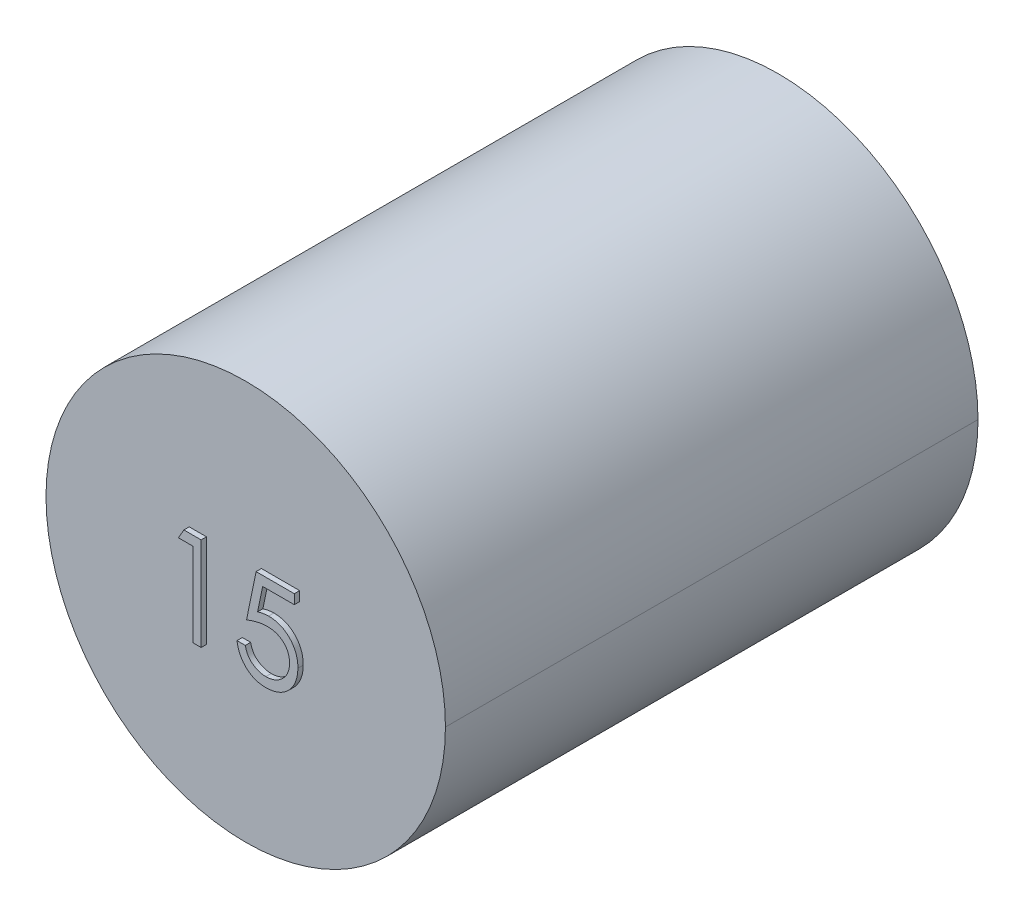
ISO-10303-21;
HEADER;
FILE_DESCRIPTION(('STEP AP214'),'2;1');
FILE_NAME('part.step','',(''),(''),'','','');
FILE_SCHEMA(('AUTOMOTIVE_DESIGN { 1 0 10303 214 1 1 1 1 }'));
ENDSEC;
DATA;
#1=APPLICATION_CONTEXT('core data for automotive mechanical design processes');
#2=APPLICATION_PROTOCOL_DEFINITION('international standard','automotive_design',2000,#1);
#3=PRODUCT_CONTEXT('',#1,'mechanical');
#4=PRODUCT('Part','Part','',(#3));
#5=PRODUCT_RELATED_PRODUCT_CATEGORY('part','',(#4));
#6=PRODUCT_DEFINITION_FORMATION('','',#4);
#7=PRODUCT_DEFINITION_CONTEXT('part definition',#1,'design');
#8=PRODUCT_DEFINITION('design','',#6,#7);
#9=PRODUCT_DEFINITION_SHAPE('','',#8);
#10=(LENGTH_UNIT() NAMED_UNIT(*) SI_UNIT(.MILLI.,.METRE.));
#11=(NAMED_UNIT(*) PLANE_ANGLE_UNIT() SI_UNIT($,.RADIAN.));
#12=(NAMED_UNIT(*) SI_UNIT($,.STERADIAN.) SOLID_ANGLE_UNIT());
#13=UNCERTAINTY_MEASURE_WITH_UNIT(LENGTH_MEASURE(1.E-05),#10,'distance_accuracy_value','');
#14=(GEOMETRIC_REPRESENTATION_CONTEXT(3) GLOBAL_UNCERTAINTY_ASSIGNED_CONTEXT((#13)) GLOBAL_UNIT_ASSIGNED_CONTEXT((#10,
#11,#12)) REPRESENTATION_CONTEXT('',''));
#15=CARTESIAN_POINT('',(0.,0.,0.));
#16=DIRECTION('',(0.,0.,1.));
#17=DIRECTION('',(1.,0.,0.));
#18=AXIS2_PLACEMENT_3D('',#15,#16,#17);
#19=CARTESIAN_POINT('',(0.850286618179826,0.469279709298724,0.2));
#20=DIRECTION('',(0.,0.,1.));
#21=DIRECTION('',(1.,0.,0.));
#22=AXIS2_PLACEMENT_3D('',#19,#20,#21);
#23=PLANE('',#22);
#24=DIRECTION('',(1.,0.,0.));
#25=VECTOR('',#24,1.);
#26=CARTESIAN_POINT('',(0.58974358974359,1.7,0.2));
#27=LINE('',#26,#25);
#28=CARTESIAN_POINT('',(0.58974358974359,1.7,0.2));
#29=VERTEX_POINT('',#28);
#30=CARTESIAN_POINT('',(2.02564102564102,1.7,0.2));
#31=VERTEX_POINT('',#30);
#32=EDGE_CURVE('E316',#29,#31,#27,.T.);
#33=ORIENTED_EDGE('',*,*,#32,.F.);
#34=DIRECTION('',(0.200944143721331,0.97960270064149,0.));
#35=VECTOR('',#34,1.);
#36=CARTESIAN_POINT('',(0.230769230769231,-0.05,0.2));
#37=LINE('',#36,#35);
#38=CARTESIAN_POINT('',(0.230769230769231,-0.05,0.2));
#39=VERTEX_POINT('',#38);
#40=EDGE_CURVE('E326',#39,#29,#37,.T.);
#41=ORIENTED_EDGE('',*,*,#40,.F.);
#42=CARTESIAN_POINT('',(1.00200320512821,0.12948717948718,0.2));
#43=CARTESIAN_POINT('',(0.974874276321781,0.128906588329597,0.2));
#44=CARTESIAN_POINT('',(0.918859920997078,0.127707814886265,0.2));
#45=CARTESIAN_POINT('',(0.832937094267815,0.118881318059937,0.2));
#46=CARTESIAN_POINT('',(0.742645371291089,0.104642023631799,0.2));
#47=CARTESIAN_POINT('',(0.648330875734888,0.0850557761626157,0.2));
#48=CARTESIAN_POINT('',(0.54971036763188,0.0594246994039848,0.2));
#49=CARTESIAN_POINT('',(0.446991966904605,0.0287101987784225,0.2));
#50=CARTESIAN_POINT('',(0.339959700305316,-0.00801179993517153,0.2));
#51=CARTESIAN_POINT('',(0.267841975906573,-0.0357440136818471,0.2));
#52=CARTESIAN_POINT('',(0.230769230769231,-0.05,0.2));
#53=(BOUNDED_CURVE() B_SPLINE_CURVE(3,(#42,#43,#44,#45,#46,#47,#48,#49,#50,#51,#52),
.UNSPECIFIED.,.F.,.F.) B_SPLINE_CURVE_WITH_KNOTS((4,1,1,1,1,1,1,1,4),(0.,0.102203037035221,
0.211023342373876,0.325099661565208,0.44650209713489,0.573787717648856,0.708900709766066,
0.850357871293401,1.),
.UNSPECIFIED.) CURVE() GEOMETRIC_REPRESENTATION_ITEM() RATIONAL_B_SPLINE_CURVE((1.,1.,1.,1.,1.,
1.,1.,1.,1.,1.,1.)) REPRESENTATION_ITEM(''));
#54=CARTESIAN_POINT('',(1.00200320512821,0.12948717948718,0.2));
#55=VERTEX_POINT('',#54);
#56=EDGE_CURVE('E334',#55,#39,#53,.T.);
#57=ORIENTED_EDGE('',*,*,#56,.F.);
#58=CARTESIAN_POINT('',(1.84615384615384,-0.643149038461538,0.2));
#59=CARTESIAN_POINT('',(1.8454953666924,-0.615073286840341,0.2));
#60=CARTESIAN_POINT('',(1.84420648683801,-0.560118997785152,0.2));
#61=CARTESIAN_POINT('',(1.83367591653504,-0.479719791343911,0.2));
#62=CARTESIAN_POINT('',(1.81535894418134,-0.403646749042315,0.2));
#63=CARTESIAN_POINT('',(1.78993506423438,-0.331532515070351,0.2));
#64=CARTESIAN_POINT('',(1.75765555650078,-0.263309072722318,0.2));
#65=CARTESIAN_POINT('',(1.71820924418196,-0.198906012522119,0.2));
#66=CARTESIAN_POINT('',(1.67085584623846,-0.139172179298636,0.2));
#67=CARTESIAN_POINT('',(1.6167639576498,-0.0840796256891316,0.2));
#68=CARTESIAN_POINT('',(1.55750591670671,-0.0332347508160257,0.2));
#69=CARTESIAN_POINT('',(1.49206217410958,0.0101093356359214,0.2));
#70=CARTESIAN_POINT('',(1.42180224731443,0.0465732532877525,0.2));
#71=CARTESIAN_POINT('',(1.34757264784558,0.0780412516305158,0.2));
#72=CARTESIAN_POINT('',(1.26760774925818,0.100641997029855,0.2));
#73=CARTESIAN_POINT('',(1.18349111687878,0.117609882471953,0.2));
#74=CARTESIAN_POINT('',(1.09431440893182,0.127425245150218,0.2));
#75=CARTESIAN_POINT('',(1.03334372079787,0.128787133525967,0.2));
#76=CARTESIAN_POINT('',(1.00200320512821,0.12948717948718,0.2));
#77=(BOUNDED_CURVE() B_SPLINE_CURVE(3,(#58,#59,#60,#61,#62,#63,#64,#65,#66,#67,#68,#69,#70,#71,
#72,#73,#74,#75,#76),.UNSPECIFIED.,.F.,.F.) B_SPLINE_CURVE_WITH_KNOTS((4,1,1,1,1,1,1,1,1,1,1,1,
1,1,1,1,4),(0.,0.0653513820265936,0.127916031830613,0.1883602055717,0.247216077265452,
0.305630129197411,0.363769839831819,0.42266091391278,0.482687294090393,0.543300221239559,
0.604117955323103,0.664964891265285,0.727413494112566,0.791467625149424,0.8580554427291,
0.927036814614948,1.),
.UNSPECIFIED.) CURVE() GEOMETRIC_REPRESENTATION_ITEM() RATIONAL_B_SPLINE_CURVE((1.,1.,1.,1.,1.,
1.,1.,1.,1.,1.,1.,1.,1.,1.,1.,1.,1.,1.,1.)) REPRESENTATION_ITEM(''));
#78=CARTESIAN_POINT('',(1.84615384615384,-0.643149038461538,0.2));
#79=VERTEX_POINT('',#78);
#80=EDGE_CURVE('E333',#79,#55,#77,.T.);
#81=ORIENTED_EDGE('',*,*,#80,.F.);
#82=CARTESIAN_POINT('',(0.957832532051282,-1.53076923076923,0.2));
#83=CARTESIAN_POINT('',(0.98779097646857,-1.52994845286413,0.2));
#84=CARTESIAN_POINT('',(1.04677939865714,-1.52833233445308,0.2));
#85=CARTESIAN_POINT('',(1.13359078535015,-1.51589332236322,0.2));
#86=CARTESIAN_POINT('',(1.21740365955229,-1.4967357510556,0.2));
#87=CARTESIAN_POINT('',(1.29739101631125,-1.46806589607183,0.2));
#88=CARTESIAN_POINT('',(1.3749525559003,-1.43322117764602,0.2));
#89=CARTESIAN_POINT('',(1.44812632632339,-1.38850610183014,0.2));
#90=CARTESIAN_POINT('',(1.51902920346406,-1.33704608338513,0.2));
#91=CARTESIAN_POINT('',(1.58545733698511,-1.27808945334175,0.2));
#92=CARTESIAN_POINT('',(1.64629678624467,-1.2131197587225,0.2));
#93=CARTESIAN_POINT('',(1.70005290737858,-1.14364236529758,0.2));
#94=CARTESIAN_POINT('',(1.74482982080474,-1.06952551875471,0.2));
#95=CARTESIAN_POINT('',(1.78256392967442,-0.99205236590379,0.2));
#96=CARTESIAN_POINT('',(1.81121722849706,-0.910373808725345,0.2));
#97=CARTESIAN_POINT('',(1.83165820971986,-0.824872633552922,0.2));
#98=CARTESIAN_POINT('',(1.84366126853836,-0.735337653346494,0.2));
#99=CARTESIAN_POINT('',(1.84531244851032,-0.674268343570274,0.2));
#100=CARTESIAN_POINT('',(1.84615384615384,-0.643149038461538,0.2));
#101=(BOUNDED_CURVE() B_SPLINE_CURVE(3,(#82,#83,#84,#85,#86,#87,#88,#89,#90,#91,#92,#93,#94,#95,
#96,#97,#98,#99,#100),.UNSPECIFIED.,.F.,.F.) B_SPLINE_CURVE_WITH_KNOTS((4,1,1,1,1,1,1,1,1,1,1,1,
1,1,1,1,4),(0.,0.0642072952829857,0.126424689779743,0.187680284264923,0.248216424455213,
0.308305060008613,0.369660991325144,0.43169855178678,0.495946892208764,0.55975802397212,
0.622295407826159,0.683910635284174,0.745092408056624,0.806740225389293,0.869086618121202,
0.933290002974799,1.),
.UNSPECIFIED.) CURVE() GEOMETRIC_REPRESENTATION_ITEM() RATIONAL_B_SPLINE_CURVE((1.,1.,1.,1.,1.,
1.,1.,1.,1.,1.,1.,1.,1.,1.,1.,1.,1.,1.,1.)) REPRESENTATION_ITEM(''));
#102=CARTESIAN_POINT('',(0.957832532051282,-1.53076923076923,0.2));
#103=VERTEX_POINT('',#102);
#104=EDGE_CURVE('E338',#103,#79,#101,.T.);
#105=ORIENTED_EDGE('',*,*,#104,.F.);
#106=CARTESIAN_POINT('',(0.185897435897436,-0.902564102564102,0.2));
#107=CARTESIAN_POINT('',(0.1936259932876,-0.935940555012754,0.2));
#108=CARTESIAN_POINT('',(0.208480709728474,-1.00009194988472,0.2));
#109=CARTESIAN_POINT('',(0.241086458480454,-1.09022329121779,0.2));
#110=CARTESIAN_POINT('',(0.280952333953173,-1.1705425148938,0.2));
#111=CARTESIAN_POINT('',(0.328356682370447,-1.24211209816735,0.2));
#112=CARTESIAN_POINT('',(0.384906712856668,-1.30452109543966,0.2));
#113=CARTESIAN_POINT('',(0.449436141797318,-1.36013815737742,0.2));
#114=CARTESIAN_POINT('',(0.521783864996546,-1.41031328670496,0.2));
#115=CARTESIAN_POINT('',(0.602177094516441,-1.45213605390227,0.2));
#116=CARTESIAN_POINT('',(0.686990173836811,-1.48780480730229,0.2));
#117=CARTESIAN_POINT('',(0.775757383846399,-1.51155650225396,0.2));
#118=CARTESIAN_POINT('',(0.866061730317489,-1.52825739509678,0.2));
#119=CARTESIAN_POINT('',(0.927140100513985,-1.52992915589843,0.2));
#120=CARTESIAN_POINT('',(0.957832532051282,-1.53076923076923,0.2));
#121=(BOUNDED_CURVE() B_SPLINE_CURVE(3,(#106,#107,#108,#109,#110,#111,#112,#113,#114,#115,#116,
#117,#118,#119,#120),.UNSPECIFIED.,.F.,.F.) B_SPLINE_CURVE_WITH_KNOTS((4,1,1,1,1,1,1,1,1,1,1,1,
4),(0.,0.0946872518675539,0.181994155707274,0.264376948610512,0.342179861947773,
0.418617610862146,0.496509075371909,0.577369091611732,0.661510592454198,0.746732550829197,
0.831257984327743,0.915205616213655,1.),
.UNSPECIFIED.) CURVE() GEOMETRIC_REPRESENTATION_ITEM() RATIONAL_B_SPLINE_CURVE((1.,1.,1.,1.,1.,
1.,1.,1.,1.,1.,1.,1.,1.,1.,1.)) REPRESENTATION_ITEM(''));
#122=CARTESIAN_POINT('',(0.185897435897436,-0.902564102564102,0.2));
#123=VERTEX_POINT('',#122);
#124=EDGE_CURVE('E349',#123,#103,#121,.T.);
#125=ORIENTED_EDGE('',*,*,#124,.F.);
#126=DIRECTION('',(1.,0.,0.));
#127=VECTOR('',#126,1.);
#128=CARTESIAN_POINT('',(-0.128205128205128,-0.902564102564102,0.2));
#129=LINE('',#128,#127);
#130=CARTESIAN_POINT('',(-0.128205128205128,-0.902564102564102,0.2));
#131=VERTEX_POINT('',#130);
#132=EDGE_CURVE('E220',#131,#123,#129,.T.);
#133=ORIENTED_EDGE('',*,*,#132,.F.);
#134=CARTESIAN_POINT('',(0.939603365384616,-1.88974358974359,0.2));
#135=CARTESIAN_POINT('',(0.904729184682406,-1.88905275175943,0.2));
#136=CARTESIAN_POINT('',(0.83611835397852,-1.88769360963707,0.2));
#137=CARTESIAN_POINT('',(0.735597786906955,-1.873475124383,0.2));
#138=CARTESIAN_POINT('',(0.638883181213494,-1.85311120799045,0.2));
#139=CARTESIAN_POINT('',(0.546753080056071,-1.8224749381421,0.2));
#140=CARTESIAN_POINT('',(0.458381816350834,-1.78408764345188,0.2));
#141=CARTESIAN_POINT('',(0.374959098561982,-1.73557147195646,0.2));
#142=CARTESIAN_POINT('',(0.294353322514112,-1.68059236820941,0.2));
#143=CARTESIAN_POINT('',(0.219841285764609,-1.61571201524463,0.2));
#144=CARTESIAN_POINT('',(0.15068517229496,-1.54479633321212,0.2));
#145=CARTESIAN_POINT('',(0.0887786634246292,-1.46783869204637,0.2));
#146=CARTESIAN_POINT('',(0.0336450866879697,-1.38610924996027,0.2));
#147=CARTESIAN_POINT('',(-0.0138326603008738,-1.29921109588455,0.2));
#148=CARTESIAN_POINT('',(-0.0543306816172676,-1.20737256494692,0.2));
#149=CARTESIAN_POINT('',(-0.0861456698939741,-1.11024956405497,0.2));
#150=CARTESIAN_POINT('',(-0.111824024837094,-1.00834956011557,0.2));
#151=CARTESIAN_POINT('',(-0.122687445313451,-0.93819604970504,0.2));
#152=CARTESIAN_POINT('',(-0.128205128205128,-0.902564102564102,0.2));
#153=(BOUNDED_CURVE() B_SPLINE_CURVE(3,(#134,#135,#136,#137,#138,#139,#140,#141,#142,#143,#144,
#145,#146,#147,#148,#149,#150,#151,#152),.UNSPECIFIED.,.F.,.F.) B_SPLINE_CURVE_WITH_KNOTS((4,1,
1,1,1,1,1,1,1,1,1,1,1,1,1,1,4),(0.,0.0654211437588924,0.128708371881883,0.190236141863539,
0.250724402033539,0.310637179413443,0.370766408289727,0.431614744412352,0.493522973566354,
0.555883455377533,0.61734236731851,0.678668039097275,0.740711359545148,0.802985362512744,
0.866802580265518,0.932347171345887,1.),
.UNSPECIFIED.) CURVE() GEOMETRIC_REPRESENTATION_ITEM() RATIONAL_B_SPLINE_CURVE((1.,1.,1.,1.,1.,
1.,1.,1.,1.,1.,1.,1.,1.,1.,1.,1.,1.,1.,1.)) REPRESENTATION_ITEM(''));
#154=CARTESIAN_POINT('',(0.939603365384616,-1.88974358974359,0.2));
#155=VERTEX_POINT('',#154);
#156=EDGE_CURVE('E201',#155,#131,#153,.T.);
#157=ORIENTED_EDGE('',*,*,#156,.F.);
#158=CARTESIAN_POINT('',(2.16025641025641,-0.656470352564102,0.2));
#159=CARTESIAN_POINT('',(2.15959133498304,-0.684992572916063,0.2));
#160=CARTESIAN_POINT('',(2.15827017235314,-0.741651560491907,0.2));
#161=CARTESIAN_POINT('',(2.15155158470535,-0.825795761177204,0.2));
#162=CARTESIAN_POINT('',(2.13861586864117,-0.908158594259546,0.2));
#163=CARTESIAN_POINT('',(2.12124814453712,-0.988750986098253,0.2));
#164=CARTESIAN_POINT('',(2.09870572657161,-1.06742035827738,0.2));
#165=CARTESIAN_POINT('',(2.07141667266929,-1.14439188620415,0.2));
#166=CARTESIAN_POINT('',(2.03802064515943,-1.21918649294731,0.2));
#167=CARTESIAN_POINT('',(2.00138926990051,-1.29251188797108,0.2));
#168=CARTESIAN_POINT('',(1.96014279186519,-1.3627103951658,0.2));
#169=CARTESIAN_POINT('',(1.91436428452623,-1.42835938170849,0.2));
#170=CARTESIAN_POINT('',(1.8659987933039,-1.49044366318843,0.2));
#171=CARTESIAN_POINT('',(1.81395740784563,-1.54829739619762,0.2));
#172=CARTESIAN_POINT('',(1.75775641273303,-1.60154041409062,0.2));
#173=CARTESIAN_POINT('',(1.69807644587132,-1.65048869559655,0.2));
#174=CARTESIAN_POINT('',(1.6353937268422,-1.69597002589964,0.2));
#175=CARTESIAN_POINT('',(1.56873848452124,-1.73613822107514,0.2));
#176=CARTESIAN_POINT('',(1.49959600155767,-1.77310117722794,0.2));
#177=CARTESIAN_POINT('',(1.42696778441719,-1.80342471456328,0.2));
#178=CARTESIAN_POINT('',(1.35250708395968,-1.83053524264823,0.2));
#179=CARTESIAN_POINT('',(1.27514220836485,-1.85214477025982,0.2));
#180=CARTESIAN_POINT('',(1.19504839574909,-1.86907732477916,0.2));
#181=CARTESIAN_POINT('',(1.11209362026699,-1.88057792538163,0.2));
#182=CARTESIAN_POINT('',(1.02671295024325,-1.88895436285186,0.2));
#183=CARTESIAN_POINT('',(0.968837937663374,-1.88947871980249,0.2));
#184=CARTESIAN_POINT('',(0.939603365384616,-1.88974358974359,0.2));
#185=(BOUNDED_CURVE() B_SPLINE_CURVE(3,(#158,#159,#160,#161,#162,#163,#164,#165,#166,#167,#168,
#169,#170,#171,#172,#173,#174,#175,#176,#177,#178,#179,#180,#181,#182,#183,#184),.UNSPECIFIED.,
.F.,.F.) B_SPLINE_CURVE_WITH_KNOTS((4,1,1,1,1,1,1,1,1,1,1,1,1,1,1,1,1,1,1,1,1,1,1,1,4),(0.,
0.0440144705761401,0.0874341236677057,0.130118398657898,0.172553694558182,0.214554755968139,
0.256298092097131,0.29843822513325,0.340849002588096,0.382715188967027,0.423924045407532,
0.464246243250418,0.504073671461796,0.543861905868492,0.583566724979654,0.623094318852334,
0.663229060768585,0.70355125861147,0.743937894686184,0.784541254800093,0.825750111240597,
0.867757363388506,0.91074516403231,0.954914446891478,1.),
.UNSPECIFIED.) CURVE() GEOMETRIC_REPRESENTATION_ITEM() RATIONAL_B_SPLINE_CURVE((1.,1.,1.,1.,1.,
1.,1.,1.,1.,1.,1.,1.,1.,1.,1.,1.,1.,1.,1.,1.,1.,1.,1.,1.,1.,1.,1.)) REPRESENTATION_ITEM(''));
#186=CARTESIAN_POINT('',(2.16025641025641,-0.656470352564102,0.2));
#187=VERTEX_POINT('',#186);
#188=EDGE_CURVE('E207',#187,#155,#185,.T.);
#189=ORIENTED_EDGE('',*,*,#188,.F.);
#190=CARTESIAN_POINT('',(1.05879407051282,0.488461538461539,0.2));
#191=CARTESIAN_POINT('',(1.09787781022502,0.487615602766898,0.2));
#192=CARTESIAN_POINT('',(1.17472620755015,0.485952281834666,0.2));
#193=CARTESIAN_POINT('',(1.28716515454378,0.469980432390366,0.2));
#194=CARTESIAN_POINT('',(1.3944980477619,0.444840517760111,0.2));
#195=CARTESIAN_POINT('',(1.49650041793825,0.40971999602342,0.2));
#196=CARTESIAN_POINT('',(1.59336096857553,0.364810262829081,0.2));
#197=CARTESIAN_POINT('',(1.68418853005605,0.308710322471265,0.2));
#198=CARTESIAN_POINT('',(1.77034644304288,0.243176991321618,0.2));
#199=CARTESIAN_POINT('',(1.85028903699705,0.167831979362,0.2));
#200=CARTESIAN_POINT('',(1.92281334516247,0.084910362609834,0.2));
#201=CARTESIAN_POINT('',(1.98657933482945,-0.0042475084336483,0.2));
#202=CARTESIAN_POINT('',(2.04074192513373,-0.0987751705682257,0.2));
#203=CARTESIAN_POINT('',(2.08430268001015,-0.199575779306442,0.2));
#204=CARTESIAN_POINT('',(2.11908701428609,-0.305534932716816,0.2));
#205=CARTESIAN_POINT('',(2.1422390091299,-0.41776751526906,0.2));
#206=CARTESIAN_POINT('',(2.15765571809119,-0.53521563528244,0.2));
#207=CARTESIAN_POINT('',(2.15937810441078,-0.615520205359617,0.2));
#208=CARTESIAN_POINT('',(2.16025641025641,-0.656470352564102,0.2));
#209=(BOUNDED_CURVE() B_SPLINE_CURVE(3,(#190,#191,#192,#193,#194,#195,#196,#197,#198,#199,#200,
#201,#202,#203,#204,#205,#206,#207,#208),.UNSPECIFIED.,.F.,.F.) B_SPLINE_CURVE_WITH_KNOTS((4,1,
1,1,1,1,1,1,1,1,1,1,1,1,1,1,4),(0.,0.0658076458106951,0.129394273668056,0.19089406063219,
0.251281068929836,0.310814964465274,0.370370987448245,0.430768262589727,0.492881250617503,
0.55510394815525,0.616067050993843,0.677256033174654,0.738259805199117,0.800762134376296,
0.864777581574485,0.931045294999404,1.),
.UNSPECIFIED.) CURVE() GEOMETRIC_REPRESENTATION_ITEM() RATIONAL_B_SPLINE_CURVE((1.,1.,1.,1.,1.,
1.,1.,1.,1.,1.,1.,1.,1.,1.,1.,1.,1.,1.,1.)) REPRESENTATION_ITEM(''));
#210=CARTESIAN_POINT('',(1.05879407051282,0.488461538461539,0.2));
#211=VERTEX_POINT('',#210);
#212=EDGE_CURVE('E261',#211,#187,#209,.T.);
#213=ORIENTED_EDGE('',*,*,#212,.F.);
#214=CARTESIAN_POINT('',(0.646534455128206,0.420452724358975,0.2));
#215=CARTESIAN_POINT('',(0.683590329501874,0.430682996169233,0.2));
#216=CARTESIAN_POINT('',(0.755380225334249,0.450502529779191,0.2));
#217=CARTESIAN_POINT('',(0.861340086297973,0.472508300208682,0.2));
#218=CARTESIAN_POINT('',(0.961932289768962,0.485773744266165,0.2));
#219=CARTESIAN_POINT('',(1.02720766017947,0.487585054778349,0.2));
#220=CARTESIAN_POINT('',(1.05879407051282,0.488461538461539,0.2));
#221=(BOUNDED_CURVE() B_SPLINE_CURVE(3,(#214,#215,#216,#217,#218,#219,#220),.UNSPECIFIED.,.F.,
.F.) B_SPLINE_CURVE_WITH_KNOTS((4,1,1,1,4),(0.,0.275068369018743,0.532901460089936,
0.773973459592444,1.),
.UNSPECIFIED.) CURVE() GEOMETRIC_REPRESENTATION_ITEM() RATIONAL_B_SPLINE_CURVE((1.,1.,1.,1.,1.,
1.,1.)) REPRESENTATION_ITEM(''));
#222=CARTESIAN_POINT('',(0.646534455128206,0.420452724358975,0.2));
#223=VERTEX_POINT('',#222);
#224=EDGE_CURVE('E278',#223,#211,#221,.T.);
#225=ORIENTED_EDGE('',*,*,#224,.F.);
#226=DIRECTION('',(-0.200705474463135,-0.979651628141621,0.));
#227=VECTOR('',#226,1.);
#228=CARTESIAN_POINT('',(0.835136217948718,1.34102564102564,0.2));
#229=LINE('',#228,#227);
#230=CARTESIAN_POINT('',(0.835136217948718,1.34102564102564,0.2));
#231=VERTEX_POINT('',#230);
#232=EDGE_CURVE('E295',#231,#223,#229,.T.);
#233=ORIENTED_EDGE('',*,*,#232,.F.);
#234=DIRECTION('',(-1.,0.,0.));
#235=VECTOR('',#234,1.);
#236=CARTESIAN_POINT('',(2.02564102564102,1.34102564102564,0.2));
#237=LINE('',#236,#235);
#238=CARTESIAN_POINT('',(2.02564102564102,1.34102564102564,0.2));
#239=VERTEX_POINT('',#238);
#240=EDGE_CURVE('E24',#239,#231,#237,.T.);
#241=ORIENTED_EDGE('',*,*,#240,.F.);
#242=DIRECTION('',(0.,-1.,0.));
#243=VECTOR('',#242,1.);
#244=CARTESIAN_POINT('',(2.02564102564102,1.7,0.2));
#245=LINE('',#244,#243);
#246=EDGE_CURVE('E9',#31,#239,#245,.T.);
#247=ORIENTED_EDGE('',*,*,#246,.F.);
#248=EDGE_LOOP('',(#33,#41,#57,#81,#105,#125,#133,#157,#189,#213,#225,#233,#241,#247));
#249=FACE_BOUND('',#248,.T.);
#250=ADVANCED_FACE('F15',(#249),#23,.T.);
#251=CARTESIAN_POINT('',(2.02564102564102,1.7,0.2));
#252=DIRECTION('',(1.,0.,0.));
#253=DIRECTION('',(0.,1.,0.));
#254=AXIS2_PLACEMENT_3D('',#251,#252,#253);
#255=PLANE('',#254);
#256=DIRECTION('',(0.,-1.,0.));
#257=VECTOR('',#256,1.);
#258=CARTESIAN_POINT('',(2.02564102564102,1.7,0.));
#259=LINE('',#258,#257);
#260=CARTESIAN_POINT('',(2.02564102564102,1.7,0.));
#261=VERTEX_POINT('',#260);
#262=CARTESIAN_POINT('',(2.02564102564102,1.34102564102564,0.));
#263=VERTEX_POINT('',#262);
#264=EDGE_CURVE('E502',#261,#263,#259,.T.);
#265=ORIENTED_EDGE('',*,*,#264,.F.);
#266=DIRECTION('',(0.,0.,-1.));
#267=VECTOR('',#266,1.);
#268=CARTESIAN_POINT('',(2.02564102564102,1.7,0.2));
#269=LINE('',#268,#267);
#270=EDGE_CURVE('E320',#31,#261,#269,.T.);
#271=ORIENTED_EDGE('',*,*,#270,.F.);
#272=ORIENTED_EDGE('',*,*,#246,.T.);
#273=DIRECTION('',(0.,0.,-1.));
#274=VECTOR('',#273,1.);
#275=CARTESIAN_POINT('',(2.02564102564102,1.34102564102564,0.2));
#276=LINE('',#275,#274);
#277=EDGE_CURVE('E301',#239,#263,#276,.T.);
#278=ORIENTED_EDGE('',*,*,#277,.T.);
#279=EDGE_LOOP('',(#265,#271,#272,#278));
#280=FACE_BOUND('',#279,.T.);
#281=ADVANCED_FACE('F599',(#280),#255,.T.);
#282=CARTESIAN_POINT('',(2.02564102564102,1.34102564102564,0.2));
#283=DIRECTION('',(0.,-1.,0.));
#284=DIRECTION('',(0.,0.,-1.));
#285=AXIS2_PLACEMENT_3D('',#282,#283,#284);
#286=PLANE('',#285);
#287=DIRECTION('',(-1.,0.,0.));
#288=VECTOR('',#287,1.);
#289=CARTESIAN_POINT('',(2.02564102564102,1.34102564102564,0.));
#290=LINE('',#289,#288);
#291=CARTESIAN_POINT('',(0.835136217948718,1.34102564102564,0.));
#292=VERTEX_POINT('',#291);
#293=EDGE_CURVE('E391',#263,#292,#290,.T.);
#294=ORIENTED_EDGE('',*,*,#293,.F.);
#295=ORIENTED_EDGE('',*,*,#277,.F.);
#296=ORIENTED_EDGE('',*,*,#240,.T.);
#297=DIRECTION('',(0.,0.,-1.));
#298=VECTOR('',#297,1.);
#299=CARTESIAN_POINT('',(0.835136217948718,1.34102564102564,0.2));
#300=LINE('',#299,#298);
#301=EDGE_CURVE('E286',#231,#292,#300,.T.);
#302=ORIENTED_EDGE('',*,*,#301,.T.);
#303=EDGE_LOOP('',(#294,#295,#296,#302));
#304=FACE_BOUND('',#303,.T.);
#305=ADVANCED_FACE('F552',(#304),#286,.T.);
#306=CARTESIAN_POINT('',(0.835136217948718,1.34102564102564,0.2));
#307=DIRECTION('',(0.979651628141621,-0.200705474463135,0.));
#308=DIRECTION('',(0.,0.,-1.));
#309=AXIS2_PLACEMENT_3D('',#306,#307,#308);
#310=PLANE('',#309);
#311=DIRECTION('',(-0.200705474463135,-0.979651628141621,0.));
#312=VECTOR('',#311,1.);
#313=CARTESIAN_POINT('',(0.835136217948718,1.34102564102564,0.));
#314=LINE('',#313,#312);
#315=CARTESIAN_POINT('',(0.646534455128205,0.420452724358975,0.));
#316=VERTEX_POINT('',#315);
#317=EDGE_CURVE('E392',#292,#316,#314,.T.);
#318=ORIENTED_EDGE('',*,*,#317,.F.);
#319=ORIENTED_EDGE('',*,*,#301,.F.);
#320=ORIENTED_EDGE('',*,*,#232,.T.);
#321=DIRECTION('',(0.,0.,-1.));
#322=VECTOR('',#321,1.);
#323=CARTESIAN_POINT('',(0.646534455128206,0.420452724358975,0.2));
#324=LINE('',#323,#322);
#325=EDGE_CURVE('E269',#223,#316,#324,.T.);
#326=ORIENTED_EDGE('',*,*,#325,.T.);
#327=EDGE_LOOP('',(#318,#319,#320,#326));
#328=FACE_BOUND('',#327,.T.);
#329=ADVANCED_FACE('F556',(#328),#310,.T.);
#330=CARTESIAN_POINT('',(0.646534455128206,0.420452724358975,0.2));
#331=CARTESIAN_POINT('',(0.646534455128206,0.420452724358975,0.));
#332=CARTESIAN_POINT('',(0.683590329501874,0.430682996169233,0.2));
#333=CARTESIAN_POINT('',(0.683590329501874,0.430682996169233,0.));
#334=CARTESIAN_POINT('',(0.755380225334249,0.450502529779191,0.2));
#335=CARTESIAN_POINT('',(0.755380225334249,0.450502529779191,0.));
#336=CARTESIAN_POINT('',(0.861340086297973,0.472508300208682,0.2));
#337=CARTESIAN_POINT('',(0.861340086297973,0.472508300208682,0.));
#338=CARTESIAN_POINT('',(0.961932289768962,0.485773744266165,0.2));
#339=CARTESIAN_POINT('',(0.961932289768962,0.485773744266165,0.));
#340=CARTESIAN_POINT('',(1.02720766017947,0.487585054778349,0.2));
#341=CARTESIAN_POINT('',(1.02720766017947,0.487585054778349,0.));
#342=CARTESIAN_POINT('',(1.05879407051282,0.488461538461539,0.2));
#343=CARTESIAN_POINT('',(1.05879407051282,0.488461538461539,0.));
#344=(BOUNDED_SURFACE() B_SPLINE_SURFACE(3,1,((#330,#331),(#332,#333),(#334,#335),(#336,#337),
(#338,#339),(#340,#341),(#342,#343)),.UNSPECIFIED.,.F.,.F.,.F.) B_SPLINE_SURFACE_WITH_KNOTS((4,
1,1,1,4),(2,2),(0.,0.275068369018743,0.532901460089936,0.773973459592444,1.),(0.,1.),
.UNSPECIFIED.) GEOMETRIC_REPRESENTATION_ITEM() RATIONAL_B_SPLINE_SURFACE(((1.,1.),(1.,1.),(1.,
1.),(1.,1.),(1.,1.),(1.,1.),(1.,1.))) REPRESENTATION_ITEM('') SURFACE());
#345=CARTESIAN_POINT('',(0.646534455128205,0.420452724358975,0.));
#346=CARTESIAN_POINT('',(0.683590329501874,0.430682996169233,0.));
#347=CARTESIAN_POINT('',(0.755380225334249,0.450502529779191,0.));
#348=CARTESIAN_POINT('',(0.861340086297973,0.472508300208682,0.));
#349=CARTESIAN_POINT('',(0.961932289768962,0.485773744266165,0.));
#350=CARTESIAN_POINT('',(1.02720766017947,0.487585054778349,0.));
#351=CARTESIAN_POINT('',(1.05879407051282,0.488461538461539,0.));
#352=(BOUNDED_CURVE() B_SPLINE_CURVE(3,(#345,#346,#347,#348,#349,#350,#351),.UNSPECIFIED.,.F.,
.F.) B_SPLINE_CURVE_WITH_KNOTS((4,1,1,1,4),(0.,0.275068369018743,0.532901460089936,
0.773973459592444,1.),
.UNSPECIFIED.) CURVE() GEOMETRIC_REPRESENTATION_ITEM() RATIONAL_B_SPLINE_CURVE((1.,1.,1.,1.,1.,
1.,1.)) REPRESENTATION_ITEM(''));
#353=CARTESIAN_POINT('',(1.05879407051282,0.488461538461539,0.));
#354=VERTEX_POINT('',#353);
#355=EDGE_CURVE('E398',#316,#354,#352,.T.);
#356=DIRECTION('',(0.,0.,-1.));
#357=VECTOR('',#356,1.);
#358=CARTESIAN_POINT('',(1.05879407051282,0.488461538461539,0.2));
#359=LINE('',#358,#357);
#360=EDGE_CURVE('E216',#211,#354,#359,.T.);
#361=ORIENTED_EDGE('',*,*,#355,.F.);
#362=ORIENTED_EDGE('',*,*,#325,.F.);
#363=ORIENTED_EDGE('',*,*,#224,.T.);
#364=ORIENTED_EDGE('',*,*,#360,.T.);
#365=EDGE_LOOP('',(#361,#362,#363,#364));
#366=FACE_BOUND('',#365,.T.);
#367=ADVANCED_FACE('F561',(#366),#344,.T.);
#368=CARTESIAN_POINT('',(1.05879407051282,0.488461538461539,0.2));
#369=CARTESIAN_POINT('',(1.05879407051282,0.488461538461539,0.));
#370=CARTESIAN_POINT('',(1.09787781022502,0.487615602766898,0.2));
#371=CARTESIAN_POINT('',(1.09787781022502,0.487615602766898,0.));
#372=CARTESIAN_POINT('',(1.17472620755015,0.485952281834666,0.2));
#373=CARTESIAN_POINT('',(1.17472620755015,0.485952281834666,0.));
#374=CARTESIAN_POINT('',(1.28716515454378,0.469980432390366,0.2));
#375=CARTESIAN_POINT('',(1.28716515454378,0.469980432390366,0.));
#376=CARTESIAN_POINT('',(1.3944980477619,0.444840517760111,0.2));
#377=CARTESIAN_POINT('',(1.3944980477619,0.444840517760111,0.));
#378=CARTESIAN_POINT('',(1.49650041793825,0.40971999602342,0.2));
#379=CARTESIAN_POINT('',(1.49650041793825,0.40971999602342,0.));
#380=CARTESIAN_POINT('',(1.59336096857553,0.364810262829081,0.2));
#381=CARTESIAN_POINT('',(1.59336096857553,0.364810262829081,0.));
#382=CARTESIAN_POINT('',(1.68418853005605,0.308710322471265,0.2));
#383=CARTESIAN_POINT('',(1.68418853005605,0.308710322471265,0.));
#384=CARTESIAN_POINT('',(1.77034644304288,0.243176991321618,0.2));
#385=CARTESIAN_POINT('',(1.77034644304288,0.243176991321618,0.));
#386=CARTESIAN_POINT('',(1.85028903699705,0.167831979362,0.2));
#387=CARTESIAN_POINT('',(1.85028903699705,0.167831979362,0.));
#388=CARTESIAN_POINT('',(1.92281334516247,0.084910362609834,0.2));
#389=CARTESIAN_POINT('',(1.92281334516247,0.084910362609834,0.));
#390=CARTESIAN_POINT('',(1.98657933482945,-0.0042475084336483,0.2));
#391=CARTESIAN_POINT('',(1.98657933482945,-0.0042475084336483,0.));
#392=CARTESIAN_POINT('',(2.04074192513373,-0.0987751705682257,0.2));
#393=CARTESIAN_POINT('',(2.04074192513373,-0.0987751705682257,0.));
#394=CARTESIAN_POINT('',(2.08430268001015,-0.199575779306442,0.2));
#395=CARTESIAN_POINT('',(2.08430268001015,-0.199575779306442,0.));
#396=CARTESIAN_POINT('',(2.11908701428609,-0.305534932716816,0.2));
#397=CARTESIAN_POINT('',(2.11908701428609,-0.305534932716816,0.));
#398=CARTESIAN_POINT('',(2.1422390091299,-0.41776751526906,0.2));
#399=CARTESIAN_POINT('',(2.1422390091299,-0.41776751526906,0.));
#400=CARTESIAN_POINT('',(2.15765571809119,-0.53521563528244,0.2));
#401=CARTESIAN_POINT('',(2.15765571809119,-0.53521563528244,0.));
#402=CARTESIAN_POINT('',(2.15937810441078,-0.615520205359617,0.2));
#403=CARTESIAN_POINT('',(2.15937810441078,-0.615520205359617,0.));
#404=CARTESIAN_POINT('',(2.16025641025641,-0.656470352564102,0.2));
#405=CARTESIAN_POINT('',(2.16025641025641,-0.656470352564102,0.));
#406=(BOUNDED_SURFACE() B_SPLINE_SURFACE(3,1,((#368,#369),(#370,#371),(#372,#373),(#374,#375),
(#376,#377),(#378,#379),(#380,#381),(#382,#383),(#384,#385),(#386,#387),(#388,#389),(#390,#391),
(#392,#393),(#394,#395),(#396,#397),(#398,#399),(#400,#401),(#402,#403),(#404,#405)),
.UNSPECIFIED.,.F.,.F.,.F.) B_SPLINE_SURFACE_WITH_KNOTS((4,1,1,1,1,1,1,1,1,1,1,1,1,1,1,1,4),(2,
2),(0.,0.0658076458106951,0.129394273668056,0.19089406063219,0.251281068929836,
0.310814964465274,0.370370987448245,0.430768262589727,0.492881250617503,0.55510394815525,
0.616067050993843,0.677256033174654,0.738259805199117,0.800762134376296,0.864777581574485,
0.931045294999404,1.),(0.,1.),
.UNSPECIFIED.) GEOMETRIC_REPRESENTATION_ITEM() RATIONAL_B_SPLINE_SURFACE(((1.,1.),(1.,1.),(1.,
1.),(1.,1.),(1.,1.),(1.,1.),(1.,1.),(1.,1.),(1.,1.),(1.,1.),(1.,1.),(1.,1.),(1.,1.),(1.,1.),(1.,
1.),(1.,1.),(1.,1.),(1.,1.),(1.,1.))) REPRESENTATION_ITEM('') SURFACE());
#407=CARTESIAN_POINT('',(1.05879407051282,0.488461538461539,0.));
#408=CARTESIAN_POINT('',(1.09787781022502,0.487615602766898,0.));
#409=CARTESIAN_POINT('',(1.17472620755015,0.485952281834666,0.));
#410=CARTESIAN_POINT('',(1.28716515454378,0.469980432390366,0.));
#411=CARTESIAN_POINT('',(1.3944980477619,0.444840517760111,0.));
#412=CARTESIAN_POINT('',(1.49650041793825,0.40971999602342,0.));
#413=CARTESIAN_POINT('',(1.59336096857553,0.364810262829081,0.));
#414=CARTESIAN_POINT('',(1.68418853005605,0.308710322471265,0.));
#415=CARTESIAN_POINT('',(1.77034644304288,0.243176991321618,0.));
#416=CARTESIAN_POINT('',(1.85028903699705,0.167831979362,0.));
#417=CARTESIAN_POINT('',(1.92281334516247,0.084910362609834,0.));
#418=CARTESIAN_POINT('',(1.98657933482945,-0.0042475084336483,0.));
#419=CARTESIAN_POINT('',(2.04074192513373,-0.0987751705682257,0.));
#420=CARTESIAN_POINT('',(2.08430268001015,-0.199575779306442,0.));
#421=CARTESIAN_POINT('',(2.11908701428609,-0.305534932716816,0.));
#422=CARTESIAN_POINT('',(2.1422390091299,-0.41776751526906,0.));
#423=CARTESIAN_POINT('',(2.15765571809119,-0.53521563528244,0.));
#424=CARTESIAN_POINT('',(2.15937810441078,-0.615520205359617,0.));
#425=CARTESIAN_POINT('',(2.16025641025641,-0.656470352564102,0.));
#426=(BOUNDED_CURVE() B_SPLINE_CURVE(3,(#407,#408,#409,#410,#411,#412,#413,#414,#415,#416,#417,
#418,#419,#420,#421,#422,#423,#424,#425),.UNSPECIFIED.,.F.,.F.) B_SPLINE_CURVE_WITH_KNOTS((4,1,
1,1,1,1,1,1,1,1,1,1,1,1,1,1,4),(0.,0.0658076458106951,0.129394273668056,0.19089406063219,
0.251281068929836,0.310814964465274,0.370370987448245,0.430768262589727,0.492881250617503,
0.55510394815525,0.616067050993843,0.677256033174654,0.738259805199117,0.800762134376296,
0.864777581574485,0.931045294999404,1.),
.UNSPECIFIED.) CURVE() GEOMETRIC_REPRESENTATION_ITEM() RATIONAL_B_SPLINE_CURVE((1.,1.,1.,1.,1.,
1.,1.,1.,1.,1.,1.,1.,1.,1.,1.,1.,1.,1.,1.)) REPRESENTATION_ITEM(''));
#427=CARTESIAN_POINT('',(2.16025641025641,-0.656470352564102,0.));
#428=VERTEX_POINT('',#427);
#429=EDGE_CURVE('E385',#354,#428,#426,.T.);
#430=DIRECTION('',(0.,0.,-1.));
#431=VECTOR('',#430,1.);
#432=CARTESIAN_POINT('',(2.16025641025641,-0.656470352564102,0.2));
#433=LINE('',#432,#431);
#434=EDGE_CURVE('E212',#187,#428,#433,.T.);
#435=ORIENTED_EDGE('',*,*,#429,.F.);
#436=ORIENTED_EDGE('',*,*,#360,.F.);
#437=ORIENTED_EDGE('',*,*,#212,.T.);
#438=ORIENTED_EDGE('',*,*,#434,.T.);
#439=EDGE_LOOP('',(#435,#436,#437,#438));
#440=FACE_BOUND('',#439,.T.);
#441=ADVANCED_FACE('F565',(#440),#406,.T.);
#442=CARTESIAN_POINT('',(2.16025641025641,-0.656470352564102,0.2));
#443=CARTESIAN_POINT('',(2.16025641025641,-0.656470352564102,0.));
#444=CARTESIAN_POINT('',(2.15959133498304,-0.684992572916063,0.2));
#445=CARTESIAN_POINT('',(2.15959133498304,-0.684992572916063,0.));
#446=CARTESIAN_POINT('',(2.15827017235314,-0.741651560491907,0.2));
#447=CARTESIAN_POINT('',(2.15827017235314,-0.741651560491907,0.));
#448=CARTESIAN_POINT('',(2.15155158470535,-0.825795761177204,0.2));
#449=CARTESIAN_POINT('',(2.15155158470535,-0.825795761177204,0.));
#450=CARTESIAN_POINT('',(2.13861586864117,-0.908158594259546,0.2));
#451=CARTESIAN_POINT('',(2.13861586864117,-0.908158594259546,0.));
#452=CARTESIAN_POINT('',(2.12124814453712,-0.988750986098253,0.2));
#453=CARTESIAN_POINT('',(2.12124814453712,-0.988750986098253,0.));
#454=CARTESIAN_POINT('',(2.09870572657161,-1.06742035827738,0.2));
#455=CARTESIAN_POINT('',(2.09870572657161,-1.06742035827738,0.));
#456=CARTESIAN_POINT('',(2.07141667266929,-1.14439188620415,0.2));
#457=CARTESIAN_POINT('',(2.07141667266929,-1.14439188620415,0.));
#458=CARTESIAN_POINT('',(2.03802064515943,-1.21918649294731,0.2));
#459=CARTESIAN_POINT('',(2.03802064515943,-1.21918649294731,0.));
#460=CARTESIAN_POINT('',(2.00138926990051,-1.29251188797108,0.2));
#461=CARTESIAN_POINT('',(2.00138926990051,-1.29251188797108,0.));
#462=CARTESIAN_POINT('',(1.96014279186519,-1.3627103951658,0.2));
#463=CARTESIAN_POINT('',(1.96014279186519,-1.3627103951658,0.));
#464=CARTESIAN_POINT('',(1.91436428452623,-1.42835938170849,0.2));
#465=CARTESIAN_POINT('',(1.91436428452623,-1.42835938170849,0.));
#466=CARTESIAN_POINT('',(1.8659987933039,-1.49044366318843,0.2));
#467=CARTESIAN_POINT('',(1.8659987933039,-1.49044366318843,0.));
#468=CARTESIAN_POINT('',(1.81395740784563,-1.54829739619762,0.2));
#469=CARTESIAN_POINT('',(1.81395740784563,-1.54829739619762,0.));
#470=CARTESIAN_POINT('',(1.75775641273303,-1.60154041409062,0.2));
#471=CARTESIAN_POINT('',(1.75775641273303,-1.60154041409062,0.));
#472=CARTESIAN_POINT('',(1.69807644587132,-1.65048869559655,0.2));
#473=CARTESIAN_POINT('',(1.69807644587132,-1.65048869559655,0.));
#474=CARTESIAN_POINT('',(1.6353937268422,-1.69597002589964,0.2));
#475=CARTESIAN_POINT('',(1.6353937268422,-1.69597002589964,0.));
#476=CARTESIAN_POINT('',(1.56873848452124,-1.73613822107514,0.2));
#477=CARTESIAN_POINT('',(1.56873848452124,-1.73613822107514,0.));
#478=CARTESIAN_POINT('',(1.49959600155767,-1.77310117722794,0.2));
#479=CARTESIAN_POINT('',(1.49959600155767,-1.77310117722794,0.));
#480=CARTESIAN_POINT('',(1.42696778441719,-1.80342471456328,0.2));
#481=CARTESIAN_POINT('',(1.42696778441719,-1.80342471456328,0.));
#482=CARTESIAN_POINT('',(1.35250708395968,-1.83053524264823,0.2));
#483=CARTESIAN_POINT('',(1.35250708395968,-1.83053524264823,0.));
#484=CARTESIAN_POINT('',(1.27514220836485,-1.85214477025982,0.2));
#485=CARTESIAN_POINT('',(1.27514220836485,-1.85214477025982,0.));
#486=CARTESIAN_POINT('',(1.19504839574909,-1.86907732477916,0.2));
#487=CARTESIAN_POINT('',(1.19504839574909,-1.86907732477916,0.));
#488=CARTESIAN_POINT('',(1.11209362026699,-1.88057792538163,0.2));
#489=CARTESIAN_POINT('',(1.11209362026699,-1.88057792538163,0.));
#490=CARTESIAN_POINT('',(1.02671295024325,-1.88895436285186,0.2));
#491=CARTESIAN_POINT('',(1.02671295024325,-1.88895436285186,0.));
#492=CARTESIAN_POINT('',(0.968837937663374,-1.88947871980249,0.2));
#493=CARTESIAN_POINT('',(0.968837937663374,-1.88947871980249,0.));
#494=CARTESIAN_POINT('',(0.939603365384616,-1.88974358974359,0.2));
#495=CARTESIAN_POINT('',(0.939603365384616,-1.88974358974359,0.));
#496=(BOUNDED_SURFACE() B_SPLINE_SURFACE(3,1,((#442,#443),(#444,#445),(#446,#447),(#448,#449),
(#450,#451),(#452,#453),(#454,#455),(#456,#457),(#458,#459),(#460,#461),(#462,#463),(#464,#465),
(#466,#467),(#468,#469),(#470,#471),(#472,#473),(#474,#475),(#476,#477),(#478,#479),(#480,#481),
(#482,#483),(#484,#485),(#486,#487),(#488,#489),(#490,#491),(#492,#493),(#494,#495)),
.UNSPECIFIED.,.F.,.F.,.F.) B_SPLINE_SURFACE_WITH_KNOTS((4,1,1,1,1,1,1,1,1,1,1,1,1,1,1,1,1,1,1,1,
1,1,1,1,4),(2,2),(0.,0.0440144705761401,0.0874341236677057,0.130118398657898,0.172553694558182,
0.214554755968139,0.256298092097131,0.29843822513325,0.340849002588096,0.382715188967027,
0.423924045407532,0.464246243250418,0.504073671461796,0.543861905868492,0.583566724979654,
0.623094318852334,0.663229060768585,0.70355125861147,0.743937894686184,0.784541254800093,
0.825750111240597,0.867757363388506,0.91074516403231,0.954914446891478,1.),(0.,1.),
.UNSPECIFIED.) GEOMETRIC_REPRESENTATION_ITEM() RATIONAL_B_SPLINE_SURFACE(((1.,1.),(1.,1.),(1.,
1.),(1.,1.),(1.,1.),(1.,1.),(1.,1.),(1.,1.),(1.,1.),(1.,1.),(1.,1.),(1.,1.),(1.,1.),(1.,1.),(1.,
1.),(1.,1.),(1.,1.),(1.,1.),(1.,1.),(1.,1.),(1.,1.),(1.,1.),(1.,1.),(1.,1.),(1.,1.),(1.,1.),(1.,1.))) REPRESENTATION_ITEM('') SURFACE());
#497=CARTESIAN_POINT('',(2.16025641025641,-0.656470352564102,0.));
#498=CARTESIAN_POINT('',(2.15959133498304,-0.684992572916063,0.));
#499=CARTESIAN_POINT('',(2.15827017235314,-0.741651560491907,0.));
#500=CARTESIAN_POINT('',(2.15155158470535,-0.825795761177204,0.));
#501=CARTESIAN_POINT('',(2.13861586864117,-0.908158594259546,0.));
#502=CARTESIAN_POINT('',(2.12124814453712,-0.988750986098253,0.));
#503=CARTESIAN_POINT('',(2.09870572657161,-1.06742035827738,0.));
#504=CARTESIAN_POINT('',(2.07141667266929,-1.14439188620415,0.));
#505=CARTESIAN_POINT('',(2.03802064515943,-1.21918649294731,0.));
#506=CARTESIAN_POINT('',(2.00138926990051,-1.29251188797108,0.));
#507=CARTESIAN_POINT('',(1.96014279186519,-1.3627103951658,0.));
#508=CARTESIAN_POINT('',(1.91436428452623,-1.42835938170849,0.));
#509=CARTESIAN_POINT('',(1.8659987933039,-1.49044366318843,0.));
#510=CARTESIAN_POINT('',(1.81395740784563,-1.54829739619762,0.));
#511=CARTESIAN_POINT('',(1.75775641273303,-1.60154041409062,0.));
#512=CARTESIAN_POINT('',(1.69807644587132,-1.65048869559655,0.));
#513=CARTESIAN_POINT('',(1.6353937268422,-1.69597002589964,0.));
#514=CARTESIAN_POINT('',(1.56873848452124,-1.73613822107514,0.));
#515=CARTESIAN_POINT('',(1.49959600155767,-1.77310117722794,0.));
#516=CARTESIAN_POINT('',(1.42696778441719,-1.80342471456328,0.));
#517=CARTESIAN_POINT('',(1.35250708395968,-1.83053524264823,0.));
#518=CARTESIAN_POINT('',(1.27514220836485,-1.85214477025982,0.));
#519=CARTESIAN_POINT('',(1.19504839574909,-1.86907732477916,0.));
#520=CARTESIAN_POINT('',(1.11209362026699,-1.88057792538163,0.));
#521=CARTESIAN_POINT('',(1.02671295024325,-1.88895436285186,0.));
#522=CARTESIAN_POINT('',(0.968837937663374,-1.88947871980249,0.));
#523=CARTESIAN_POINT('',(0.939603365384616,-1.88974358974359,0.));
#524=(BOUNDED_CURVE() B_SPLINE_CURVE(3,(#497,#498,#499,#500,#501,#502,#503,#504,#505,#506,#507,
#508,#509,#510,#511,#512,#513,#514,#515,#516,#517,#518,#519,#520,#521,#522,#523),.UNSPECIFIED.,
.F.,.F.) B_SPLINE_CURVE_WITH_KNOTS((4,1,1,1,1,1,1,1,1,1,1,1,1,1,1,1,1,1,1,1,1,1,1,1,4),(0.,
0.0440144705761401,0.0874341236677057,0.130118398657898,0.172553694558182,0.214554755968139,
0.256298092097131,0.29843822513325,0.340849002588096,0.382715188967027,0.423924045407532,
0.464246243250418,0.504073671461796,0.543861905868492,0.583566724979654,0.623094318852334,
0.663229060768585,0.70355125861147,0.743937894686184,0.784541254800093,0.825750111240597,
0.867757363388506,0.91074516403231,0.954914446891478,1.),
.UNSPECIFIED.) CURVE() GEOMETRIC_REPRESENTATION_ITEM() RATIONAL_B_SPLINE_CURVE((1.,1.,1.,1.,1.,
1.,1.,1.,1.,1.,1.,1.,1.,1.,1.,1.,1.,1.,1.,1.,1.,1.,1.,1.,1.,1.,1.)) REPRESENTATION_ITEM(''));
#525=CARTESIAN_POINT('',(0.939603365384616,-1.88974358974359,0.));
#526=VERTEX_POINT('',#525);
#527=EDGE_CURVE('E379',#428,#526,#524,.T.);
#528=DIRECTION('',(0.,0.,-1.));
#529=VECTOR('',#528,1.);
#530=CARTESIAN_POINT('',(0.939603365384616,-1.88974358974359,0.2));
#531=LINE('',#530,#529);
#532=EDGE_CURVE('E210',#155,#526,#531,.T.);
#533=ORIENTED_EDGE('',*,*,#527,.F.);
#534=ORIENTED_EDGE('',*,*,#434,.F.);
#535=ORIENTED_EDGE('',*,*,#188,.T.);
#536=ORIENTED_EDGE('',*,*,#532,.T.);
#537=EDGE_LOOP('',(#533,#534,#535,#536));
#538=FACE_BOUND('',#537,.T.);
#539=ADVANCED_FACE('F209',(#538),#496,.T.);
#540=CARTESIAN_POINT('',(0.939603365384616,-1.88974358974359,0.2));
#541=CARTESIAN_POINT('',(0.939603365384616,-1.88974358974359,0.));
#542=CARTESIAN_POINT('',(0.904729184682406,-1.88905275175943,0.2));
#543=CARTESIAN_POINT('',(0.904729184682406,-1.88905275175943,0.));
#544=CARTESIAN_POINT('',(0.83611835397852,-1.88769360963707,0.2));
#545=CARTESIAN_POINT('',(0.83611835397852,-1.88769360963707,0.));
#546=CARTESIAN_POINT('',(0.735597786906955,-1.873475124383,0.2));
#547=CARTESIAN_POINT('',(0.735597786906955,-1.873475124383,0.));
#548=CARTESIAN_POINT('',(0.638883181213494,-1.85311120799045,0.2));
#549=CARTESIAN_POINT('',(0.638883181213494,-1.85311120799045,0.));
#550=CARTESIAN_POINT('',(0.546753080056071,-1.8224749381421,0.2));
#551=CARTESIAN_POINT('',(0.546753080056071,-1.8224749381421,0.));
#552=CARTESIAN_POINT('',(0.458381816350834,-1.78408764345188,0.2));
#553=CARTESIAN_POINT('',(0.458381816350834,-1.78408764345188,0.));
#554=CARTESIAN_POINT('',(0.374959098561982,-1.73557147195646,0.2));
#555=CARTESIAN_POINT('',(0.374959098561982,-1.73557147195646,0.));
#556=CARTESIAN_POINT('',(0.294353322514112,-1.68059236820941,0.2));
#557=CARTESIAN_POINT('',(0.294353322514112,-1.68059236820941,0.));
#558=CARTESIAN_POINT('',(0.219841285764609,-1.61571201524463,0.2));
#559=CARTESIAN_POINT('',(0.219841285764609,-1.61571201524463,0.));
#560=CARTESIAN_POINT('',(0.15068517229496,-1.54479633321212,0.2));
#561=CARTESIAN_POINT('',(0.15068517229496,-1.54479633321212,0.));
#562=CARTESIAN_POINT('',(0.0887786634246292,-1.46783869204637,0.2));
#563=CARTESIAN_POINT('',(0.0887786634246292,-1.46783869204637,0.));
#564=CARTESIAN_POINT('',(0.0336450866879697,-1.38610924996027,0.2));
#565=CARTESIAN_POINT('',(0.0336450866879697,-1.38610924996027,0.));
#566=CARTESIAN_POINT('',(-0.0138326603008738,-1.29921109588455,0.2));
#567=CARTESIAN_POINT('',(-0.0138326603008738,-1.29921109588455,0.));
#568=CARTESIAN_POINT('',(-0.0543306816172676,-1.20737256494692,0.2));
#569=CARTESIAN_POINT('',(-0.0543306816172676,-1.20737256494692,0.));
#570=CARTESIAN_POINT('',(-0.0861456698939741,-1.11024956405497,0.2));
#571=CARTESIAN_POINT('',(-0.0861456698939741,-1.11024956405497,0.));
#572=CARTESIAN_POINT('',(-0.111824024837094,-1.00834956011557,0.2));
#573=CARTESIAN_POINT('',(-0.111824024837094,-1.00834956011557,0.));
#574=CARTESIAN_POINT('',(-0.122687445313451,-0.93819604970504,0.2));
#575=CARTESIAN_POINT('',(-0.122687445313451,-0.93819604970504,0.));
#576=CARTESIAN_POINT('',(-0.128205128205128,-0.902564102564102,0.2));
#577=CARTESIAN_POINT('',(-0.128205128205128,-0.902564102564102,0.));
#578=(BOUNDED_SURFACE() B_SPLINE_SURFACE(3,1,((#540,#541),(#542,#543),(#544,#545),(#546,#547),
(#548,#549),(#550,#551),(#552,#553),(#554,#555),(#556,#557),(#558,#559),(#560,#561),(#562,#563),
(#564,#565),(#566,#567),(#568,#569),(#570,#571),(#572,#573),(#574,#575),(#576,#577)),
.UNSPECIFIED.,.F.,.F.,.F.) B_SPLINE_SURFACE_WITH_KNOTS((4,1,1,1,1,1,1,1,1,1,1,1,1,1,1,1,4),(2,
2),(0.,0.0654211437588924,0.128708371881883,0.190236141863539,0.250724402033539,
0.310637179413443,0.370766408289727,0.431614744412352,0.493522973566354,0.555883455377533,
0.61734236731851,0.678668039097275,0.740711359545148,0.802985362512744,0.866802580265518,
0.932347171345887,1.),(0.,1.),
.UNSPECIFIED.) GEOMETRIC_REPRESENTATION_ITEM() RATIONAL_B_SPLINE_SURFACE(((1.,1.),(1.,1.),(1.,
1.),(1.,1.),(1.,1.),(1.,1.),(1.,1.),(1.,1.),(1.,1.),(1.,1.),(1.,1.),(1.,1.),(1.,1.),(1.,1.),(1.,
1.),(1.,1.),(1.,1.),(1.,1.),(1.,1.))) REPRESENTATION_ITEM('') SURFACE());
#579=CARTESIAN_POINT('',(0.939603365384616,-1.88974358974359,0.));
#580=CARTESIAN_POINT('',(0.904729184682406,-1.88905275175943,0.));
#581=CARTESIAN_POINT('',(0.83611835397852,-1.88769360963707,0.));
#582=CARTESIAN_POINT('',(0.735597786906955,-1.873475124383,0.));
#583=CARTESIAN_POINT('',(0.638883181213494,-1.85311120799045,0.));
#584=CARTESIAN_POINT('',(0.546753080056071,-1.8224749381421,0.));
#585=CARTESIAN_POINT('',(0.458381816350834,-1.78408764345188,0.));
#586=CARTESIAN_POINT('',(0.374959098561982,-1.73557147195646,0.));
#587=CARTESIAN_POINT('',(0.294353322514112,-1.68059236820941,0.));
#588=CARTESIAN_POINT('',(0.219841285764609,-1.61571201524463,0.));
#589=CARTESIAN_POINT('',(0.15068517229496,-1.54479633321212,0.));
#590=CARTESIAN_POINT('',(0.0887786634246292,-1.46783869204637,0.));
#591=CARTESIAN_POINT('',(0.0336450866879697,-1.38610924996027,0.));
#592=CARTESIAN_POINT('',(-0.0138326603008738,-1.29921109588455,0.));
#593=CARTESIAN_POINT('',(-0.0543306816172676,-1.20737256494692,0.));
#594=CARTESIAN_POINT('',(-0.0861456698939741,-1.11024956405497,0.));
#595=CARTESIAN_POINT('',(-0.111824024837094,-1.00834956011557,0.));
#596=CARTESIAN_POINT('',(-0.122687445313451,-0.93819604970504,0.));
#597=CARTESIAN_POINT('',(-0.128205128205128,-0.902564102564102,0.));
#598=(BOUNDED_CURVE() B_SPLINE_CURVE(3,(#579,#580,#581,#582,#583,#584,#585,#586,#587,#588,#589,
#590,#591,#592,#593,#594,#595,#596,#597),.UNSPECIFIED.,.F.,.F.) B_SPLINE_CURVE_WITH_KNOTS((4,1,
1,1,1,1,1,1,1,1,1,1,1,1,1,1,4),(0.,0.0654211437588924,0.128708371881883,0.190236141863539,
0.250724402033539,0.310637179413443,0.370766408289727,0.431614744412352,0.493522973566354,
0.555883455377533,0.61734236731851,0.678668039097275,0.740711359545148,0.802985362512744,
0.866802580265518,0.932347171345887,1.),
.UNSPECIFIED.) CURVE() GEOMETRIC_REPRESENTATION_ITEM() RATIONAL_B_SPLINE_CURVE((1.,1.,1.,1.,1.,
1.,1.,1.,1.,1.,1.,1.,1.,1.,1.,1.,1.,1.,1.)) REPRESENTATION_ITEM(''));
#599=CARTESIAN_POINT('',(-0.128205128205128,-0.902564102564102,0.));
#600=VERTEX_POINT('',#599);
#601=EDGE_CURVE('E225',#526,#600,#598,.T.);
#602=DIRECTION('',(0.,0.,-1.));
#603=VECTOR('',#602,1.);
#604=CARTESIAN_POINT('',(-0.128205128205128,-0.902564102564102,0.2));
#605=LINE('',#604,#603);
#606=EDGE_CURVE('E232',#131,#600,#605,.T.);
#607=ORIENTED_EDGE('',*,*,#601,.F.);
#608=ORIENTED_EDGE('',*,*,#532,.F.);
#609=ORIENTED_EDGE('',*,*,#156,.T.);
#610=ORIENTED_EDGE('',*,*,#606,.T.);
#611=EDGE_LOOP('',(#607,#608,#609,#610));
#612=FACE_BOUND('',#611,.T.);
#613=ADVANCED_FACE('F223',(#612),#578,.T.);
#614=CARTESIAN_POINT('',(-0.128205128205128,-0.902564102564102,0.2));
#615=DIRECTION('',(0.,1.,0.));
#616=DIRECTION('',(1.,0.,0.));
#617=AXIS2_PLACEMENT_3D('',#614,#615,#616);
#618=PLANE('',#617);
#619=DIRECTION('',(1.,0.,0.));
#620=VECTOR('',#619,1.);
#621=CARTESIAN_POINT('',(-0.128205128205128,-0.902564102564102,0.));
#622=LINE('',#621,#620);
#623=CARTESIAN_POINT('',(0.185897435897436,-0.902564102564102,0.));
#624=VERTEX_POINT('',#623);
#625=EDGE_CURVE('E366',#600,#624,#622,.T.);
#626=ORIENTED_EDGE('',*,*,#625,.F.);
#627=ORIENTED_EDGE('',*,*,#606,.F.);
#628=ORIENTED_EDGE('',*,*,#132,.T.);
#629=DIRECTION('',(0.,0.,-1.));
#630=VECTOR('',#629,1.);
#631=CARTESIAN_POINT('',(0.185897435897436,-0.902564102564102,0.2));
#632=LINE('',#631,#630);
#633=EDGE_CURVE('E343',#123,#624,#632,.T.);
#634=ORIENTED_EDGE('',*,*,#633,.T.);
#635=EDGE_LOOP('',(#626,#627,#628,#634));
#636=FACE_BOUND('',#635,.T.);
#637=ADVANCED_FACE('F367',(#636),#618,.T.);
#638=CARTESIAN_POINT('',(0.185897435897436,-0.902564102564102,0.2));
#639=CARTESIAN_POINT('',(0.185897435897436,-0.902564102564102,0.));
#640=CARTESIAN_POINT('',(0.1936259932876,-0.935940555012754,0.2));
#641=CARTESIAN_POINT('',(0.1936259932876,-0.935940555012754,0.));
#642=CARTESIAN_POINT('',(0.208480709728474,-1.00009194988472,0.2));
#643=CARTESIAN_POINT('',(0.208480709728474,-1.00009194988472,0.));
#644=CARTESIAN_POINT('',(0.241086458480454,-1.09022329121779,0.2));
#645=CARTESIAN_POINT('',(0.241086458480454,-1.09022329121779,0.));
#646=CARTESIAN_POINT('',(0.280952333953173,-1.1705425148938,0.2));
#647=CARTESIAN_POINT('',(0.280952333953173,-1.1705425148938,0.));
#648=CARTESIAN_POINT('',(0.328356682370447,-1.24211209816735,0.2));
#649=CARTESIAN_POINT('',(0.328356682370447,-1.24211209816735,0.));
#650=CARTESIAN_POINT('',(0.384906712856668,-1.30452109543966,0.2));
#651=CARTESIAN_POINT('',(0.384906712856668,-1.30452109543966,0.));
#652=CARTESIAN_POINT('',(0.449436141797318,-1.36013815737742,0.2));
#653=CARTESIAN_POINT('',(0.449436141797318,-1.36013815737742,0.));
#654=CARTESIAN_POINT('',(0.521783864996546,-1.41031328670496,0.2));
#655=CARTESIAN_POINT('',(0.521783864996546,-1.41031328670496,0.));
#656=CARTESIAN_POINT('',(0.602177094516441,-1.45213605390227,0.2));
#657=CARTESIAN_POINT('',(0.602177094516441,-1.45213605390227,0.));
#658=CARTESIAN_POINT('',(0.686990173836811,-1.48780480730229,0.2));
#659=CARTESIAN_POINT('',(0.686990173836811,-1.48780480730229,0.));
#660=CARTESIAN_POINT('',(0.775757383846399,-1.51155650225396,0.2));
#661=CARTESIAN_POINT('',(0.775757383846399,-1.51155650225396,0.));
#662=CARTESIAN_POINT('',(0.866061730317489,-1.52825739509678,0.2));
#663=CARTESIAN_POINT('',(0.866061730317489,-1.52825739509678,0.));
#664=CARTESIAN_POINT('',(0.927140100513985,-1.52992915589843,0.2));
#665=CARTESIAN_POINT('',(0.927140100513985,-1.52992915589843,0.));
#666=CARTESIAN_POINT('',(0.957832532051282,-1.53076923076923,0.2));
#667=CARTESIAN_POINT('',(0.957832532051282,-1.53076923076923,0.));
#668=(BOUNDED_SURFACE() B_SPLINE_SURFACE(3,1,((#638,#639),(#640,#641),(#642,#643),(#644,#645),
(#646,#647),(#648,#649),(#650,#651),(#652,#653),(#654,#655),(#656,#657),(#658,#659),(#660,#661),
(#662,#663),(#664,#665),(#666,#667)),.UNSPECIFIED.,.F.,.F.,.F.) B_SPLINE_SURFACE_WITH_KNOTS((4,
1,1,1,1,1,1,1,1,1,1,1,4),(2,2),(0.,0.0946872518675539,0.181994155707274,0.264376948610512,
0.342179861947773,0.418617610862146,0.496509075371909,0.577369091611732,0.661510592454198,
0.746732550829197,0.831257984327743,0.915205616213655,1.),(0.,1.),
.UNSPECIFIED.) GEOMETRIC_REPRESENTATION_ITEM() RATIONAL_B_SPLINE_SURFACE(((1.,1.),(1.,1.),(1.,
1.),(1.,1.),(1.,1.),(1.,1.),(1.,1.),(1.,1.),(1.,1.),(1.,1.),(1.,1.),(1.,1.),(1.,1.),(1.,1.),(1.,1.))) REPRESENTATION_ITEM('') SURFACE());
#669=CARTESIAN_POINT('',(0.185897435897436,-0.902564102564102,0.));
#670=CARTESIAN_POINT('',(0.1936259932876,-0.935940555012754,0.));
#671=CARTESIAN_POINT('',(0.208480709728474,-1.00009194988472,0.));
#672=CARTESIAN_POINT('',(0.241086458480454,-1.09022329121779,0.));
#673=CARTESIAN_POINT('',(0.280952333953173,-1.1705425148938,0.));
#674=CARTESIAN_POINT('',(0.328356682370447,-1.24211209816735,0.));
#675=CARTESIAN_POINT('',(0.384906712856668,-1.30452109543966,0.));
#676=CARTESIAN_POINT('',(0.449436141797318,-1.36013815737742,0.));
#677=CARTESIAN_POINT('',(0.521783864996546,-1.41031328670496,0.));
#678=CARTESIAN_POINT('',(0.602177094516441,-1.45213605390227,0.));
#679=CARTESIAN_POINT('',(0.686990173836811,-1.48780480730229,0.));
#680=CARTESIAN_POINT('',(0.775757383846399,-1.51155650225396,0.));
#681=CARTESIAN_POINT('',(0.866061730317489,-1.52825739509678,0.));
#682=CARTESIAN_POINT('',(0.927140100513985,-1.52992915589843,0.));
#683=CARTESIAN_POINT('',(0.957832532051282,-1.53076923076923,0.));
#684=(BOUNDED_CURVE() B_SPLINE_CURVE(3,(#669,#670,#671,#672,#673,#674,#675,#676,#677,#678,#679,
#680,#681,#682,#683),.UNSPECIFIED.,.F.,.F.) B_SPLINE_CURVE_WITH_KNOTS((4,1,1,1,1,1,1,1,1,1,1,1,
4),(0.,0.0946872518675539,0.181994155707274,0.264376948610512,0.342179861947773,
0.418617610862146,0.496509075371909,0.577369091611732,0.661510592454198,0.746732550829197,
0.831257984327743,0.915205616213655,1.),
.UNSPECIFIED.) CURVE() GEOMETRIC_REPRESENTATION_ITEM() RATIONAL_B_SPLINE_CURVE((1.,1.,1.,1.,1.,
1.,1.,1.,1.,1.,1.,1.,1.,1.,1.)) REPRESENTATION_ITEM(''));
#685=CARTESIAN_POINT('',(0.957832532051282,-1.53076923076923,0.));
#686=VERTEX_POINT('',#685);
#687=EDGE_CURVE('E373',#624,#686,#684,.T.);
#688=DIRECTION('',(0.,0.,-1.));
#689=VECTOR('',#688,1.);
#690=CARTESIAN_POINT('',(0.957832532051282,-1.53076923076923,0.2));
#691=LINE('',#690,#689);
#692=EDGE_CURVE('E335',#103,#686,#691,.T.);
#693=ORIENTED_EDGE('',*,*,#687,.F.);
#694=ORIENTED_EDGE('',*,*,#633,.F.);
#695=ORIENTED_EDGE('',*,*,#124,.T.);
#696=ORIENTED_EDGE('',*,*,#692,.T.);
#697=EDGE_LOOP('',(#693,#694,#695,#696));
#698=FACE_BOUND('',#697,.T.);
#699=ADVANCED_FACE('F614',(#698),#668,.T.);
#700=CARTESIAN_POINT('',(0.957832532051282,-1.53076923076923,0.2));
#701=CARTESIAN_POINT('',(0.957832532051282,-1.53076923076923,0.));
#702=CARTESIAN_POINT('',(0.98779097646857,-1.52994845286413,0.2));
#703=CARTESIAN_POINT('',(0.98779097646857,-1.52994845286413,0.));
#704=CARTESIAN_POINT('',(1.04677939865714,-1.52833233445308,0.2));
#705=CARTESIAN_POINT('',(1.04677939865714,-1.52833233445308,0.));
#706=CARTESIAN_POINT('',(1.13359078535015,-1.51589332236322,0.2));
#707=CARTESIAN_POINT('',(1.13359078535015,-1.51589332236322,0.));
#708=CARTESIAN_POINT('',(1.21740365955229,-1.4967357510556,0.2));
#709=CARTESIAN_POINT('',(1.21740365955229,-1.4967357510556,0.));
#710=CARTESIAN_POINT('',(1.29739101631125,-1.46806589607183,0.2));
#711=CARTESIAN_POINT('',(1.29739101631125,-1.46806589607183,0.));
#712=CARTESIAN_POINT('',(1.3749525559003,-1.43322117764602,0.2));
#713=CARTESIAN_POINT('',(1.3749525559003,-1.43322117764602,0.));
#714=CARTESIAN_POINT('',(1.44812632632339,-1.38850610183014,0.2));
#715=CARTESIAN_POINT('',(1.44812632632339,-1.38850610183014,0.));
#716=CARTESIAN_POINT('',(1.51902920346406,-1.33704608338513,0.2));
#717=CARTESIAN_POINT('',(1.51902920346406,-1.33704608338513,0.));
#718=CARTESIAN_POINT('',(1.58545733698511,-1.27808945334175,0.2));
#719=CARTESIAN_POINT('',(1.58545733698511,-1.27808945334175,0.));
#720=CARTESIAN_POINT('',(1.64629678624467,-1.2131197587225,0.2));
#721=CARTESIAN_POINT('',(1.64629678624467,-1.2131197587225,0.));
#722=CARTESIAN_POINT('',(1.70005290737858,-1.14364236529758,0.2));
#723=CARTESIAN_POINT('',(1.70005290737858,-1.14364236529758,0.));
#724=CARTESIAN_POINT('',(1.74482982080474,-1.06952551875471,0.2));
#725=CARTESIAN_POINT('',(1.74482982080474,-1.06952551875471,0.));
#726=CARTESIAN_POINT('',(1.78256392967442,-0.99205236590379,0.2));
#727=CARTESIAN_POINT('',(1.78256392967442,-0.99205236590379,0.));
#728=CARTESIAN_POINT('',(1.81121722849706,-0.910373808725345,0.2));
#729=CARTESIAN_POINT('',(1.81121722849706,-0.910373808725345,0.));
#730=CARTESIAN_POINT('',(1.83165820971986,-0.824872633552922,0.2));
#731=CARTESIAN_POINT('',(1.83165820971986,-0.824872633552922,0.));
#732=CARTESIAN_POINT('',(1.84366126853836,-0.735337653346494,0.2));
#733=CARTESIAN_POINT('',(1.84366126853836,-0.735337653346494,0.));
#734=CARTESIAN_POINT('',(1.84531244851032,-0.674268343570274,0.2));
#735=CARTESIAN_POINT('',(1.84531244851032,-0.674268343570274,0.));
#736=CARTESIAN_POINT('',(1.84615384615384,-0.643149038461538,0.2));
#737=CARTESIAN_POINT('',(1.84615384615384,-0.643149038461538,0.));
#738=(BOUNDED_SURFACE() B_SPLINE_SURFACE(3,1,((#700,#701),(#702,#703),(#704,#705),(#706,#707),
(#708,#709),(#710,#711),(#712,#713),(#714,#715),(#716,#717),(#718,#719),(#720,#721),(#722,#723),
(#724,#725),(#726,#727),(#728,#729),(#730,#731),(#732,#733),(#734,#735),(#736,#737)),
.UNSPECIFIED.,.F.,.F.,.F.) B_SPLINE_SURFACE_WITH_KNOTS((4,1,1,1,1,1,1,1,1,1,1,1,1,1,1,1,4),(2,
2),(0.,0.0642072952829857,0.126424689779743,0.187680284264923,0.248216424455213,
0.308305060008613,0.369660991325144,0.43169855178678,0.495946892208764,0.55975802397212,
0.622295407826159,0.683910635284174,0.745092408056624,0.806740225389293,0.869086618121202,
0.933290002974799,1.),(0.,1.),
.UNSPECIFIED.) GEOMETRIC_REPRESENTATION_ITEM() RATIONAL_B_SPLINE_SURFACE(((1.,1.),(1.,1.),(1.,
1.),(1.,1.),(1.,1.),(1.,1.),(1.,1.),(1.,1.),(1.,1.),(1.,1.),(1.,1.),(1.,1.),(1.,1.),(1.,1.),(1.,
1.),(1.,1.),(1.,1.),(1.,1.),(1.,1.))) REPRESENTATION_ITEM('') SURFACE());
#739=CARTESIAN_POINT('',(0.957832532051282,-1.53076923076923,0.));
#740=CARTESIAN_POINT('',(0.98779097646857,-1.52994845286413,0.));
#741=CARTESIAN_POINT('',(1.04677939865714,-1.52833233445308,0.));
#742=CARTESIAN_POINT('',(1.13359078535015,-1.51589332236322,0.));
#743=CARTESIAN_POINT('',(1.21740365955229,-1.4967357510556,0.));
#744=CARTESIAN_POINT('',(1.29739101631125,-1.46806589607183,0.));
#745=CARTESIAN_POINT('',(1.3749525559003,-1.43322117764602,0.));
#746=CARTESIAN_POINT('',(1.44812632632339,-1.38850610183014,0.));
#747=CARTESIAN_POINT('',(1.51902920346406,-1.33704608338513,0.));
#748=CARTESIAN_POINT('',(1.58545733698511,-1.27808945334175,0.));
#749=CARTESIAN_POINT('',(1.64629678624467,-1.2131197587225,0.));
#750=CARTESIAN_POINT('',(1.70005290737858,-1.14364236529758,0.));
#751=CARTESIAN_POINT('',(1.74482982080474,-1.06952551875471,0.));
#752=CARTESIAN_POINT('',(1.78256392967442,-0.99205236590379,0.));
#753=CARTESIAN_POINT('',(1.81121722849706,-0.910373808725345,0.));
#754=CARTESIAN_POINT('',(1.83165820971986,-0.824872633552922,0.));
#755=CARTESIAN_POINT('',(1.84366126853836,-0.735337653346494,0.));
#756=CARTESIAN_POINT('',(1.84531244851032,-0.674268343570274,0.));
#757=CARTESIAN_POINT('',(1.84615384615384,-0.643149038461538,0.));
#758=(BOUNDED_CURVE() B_SPLINE_CURVE(3,(#739,#740,#741,#742,#743,#744,#745,#746,#747,#748,#749,
#750,#751,#752,#753,#754,#755,#756,#757),.UNSPECIFIED.,.F.,.F.) B_SPLINE_CURVE_WITH_KNOTS((4,1,
1,1,1,1,1,1,1,1,1,1,1,1,1,1,4),(0.,0.0642072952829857,0.126424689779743,0.187680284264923,
0.248216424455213,0.308305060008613,0.369660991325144,0.43169855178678,0.495946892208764,
0.55975802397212,0.622295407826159,0.683910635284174,0.745092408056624,0.806740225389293,
0.869086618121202,0.933290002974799,1.),
.UNSPECIFIED.) CURVE() GEOMETRIC_REPRESENTATION_ITEM() RATIONAL_B_SPLINE_CURVE((1.,1.,1.,1.,1.,
1.,1.,1.,1.,1.,1.,1.,1.,1.,1.,1.,1.,1.,1.)) REPRESENTATION_ITEM(''));
#759=CARTESIAN_POINT('',(1.84615384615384,-0.643149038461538,0.));
#760=VERTEX_POINT('',#759);
#761=EDGE_CURVE('E406',#686,#760,#758,.T.);
#762=DIRECTION('',(0.,0.,-1.));
#763=VECTOR('',#762,1.);
#764=CARTESIAN_POINT('',(1.84615384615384,-0.643149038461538,0.2));
#765=LINE('',#764,#763);
#766=EDGE_CURVE('E330',#79,#760,#765,.T.);
#767=ORIENTED_EDGE('',*,*,#761,.F.);
#768=ORIENTED_EDGE('',*,*,#692,.F.);
#769=ORIENTED_EDGE('',*,*,#104,.T.);
#770=ORIENTED_EDGE('',*,*,#766,.T.);
#771=EDGE_LOOP('',(#767,#768,#769,#770));
#772=FACE_BOUND('',#771,.T.);
#773=ADVANCED_FACE('F618',(#772),#738,.T.);
#774=CARTESIAN_POINT('',(1.84615384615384,-0.643149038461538,0.2));
#775=CARTESIAN_POINT('',(1.84615384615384,-0.643149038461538,0.));
#776=CARTESIAN_POINT('',(1.8454953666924,-0.615073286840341,0.2));
#777=CARTESIAN_POINT('',(1.8454953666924,-0.615073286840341,0.));
#778=CARTESIAN_POINT('',(1.84420648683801,-0.560118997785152,0.2));
#779=CARTESIAN_POINT('',(1.84420648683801,-0.560118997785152,0.));
#780=CARTESIAN_POINT('',(1.83367591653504,-0.479719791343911,0.2));
#781=CARTESIAN_POINT('',(1.83367591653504,-0.479719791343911,0.));
#782=CARTESIAN_POINT('',(1.81535894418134,-0.403646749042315,0.2));
#783=CARTESIAN_POINT('',(1.81535894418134,-0.403646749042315,0.));
#784=CARTESIAN_POINT('',(1.78993506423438,-0.331532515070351,0.2));
#785=CARTESIAN_POINT('',(1.78993506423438,-0.331532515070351,0.));
#786=CARTESIAN_POINT('',(1.75765555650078,-0.263309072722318,0.2));
#787=CARTESIAN_POINT('',(1.75765555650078,-0.263309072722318,0.));
#788=CARTESIAN_POINT('',(1.71820924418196,-0.198906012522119,0.2));
#789=CARTESIAN_POINT('',(1.71820924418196,-0.198906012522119,0.));
#790=CARTESIAN_POINT('',(1.67085584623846,-0.139172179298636,0.2));
#791=CARTESIAN_POINT('',(1.67085584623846,-0.139172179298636,0.));
#792=CARTESIAN_POINT('',(1.6167639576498,-0.0840796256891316,0.2));
#793=CARTESIAN_POINT('',(1.6167639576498,-0.0840796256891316,0.));
#794=CARTESIAN_POINT('',(1.55750591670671,-0.0332347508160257,0.2));
#795=CARTESIAN_POINT('',(1.55750591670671,-0.0332347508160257,0.));
#796=CARTESIAN_POINT('',(1.49206217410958,0.0101093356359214,0.2));
#797=CARTESIAN_POINT('',(1.49206217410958,0.0101093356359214,0.));
#798=CARTESIAN_POINT('',(1.42180224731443,0.0465732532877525,0.2));
#799=CARTESIAN_POINT('',(1.42180224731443,0.0465732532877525,0.));
#800=CARTESIAN_POINT('',(1.34757264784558,0.0780412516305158,0.2));
#801=CARTESIAN_POINT('',(1.34757264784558,0.0780412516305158,0.));
#802=CARTESIAN_POINT('',(1.26760774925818,0.100641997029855,0.2));
#803=CARTESIAN_POINT('',(1.26760774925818,0.100641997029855,0.));
#804=CARTESIAN_POINT('',(1.18349111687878,0.117609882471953,0.2));
#805=CARTESIAN_POINT('',(1.18349111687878,0.117609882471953,0.));
#806=CARTESIAN_POINT('',(1.09431440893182,0.127425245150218,0.2));
#807=CARTESIAN_POINT('',(1.09431440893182,0.127425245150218,0.));
#808=CARTESIAN_POINT('',(1.03334372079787,0.128787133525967,0.2));
#809=CARTESIAN_POINT('',(1.03334372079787,0.128787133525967,0.));
#810=CARTESIAN_POINT('',(1.00200320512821,0.12948717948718,0.2));
#811=CARTESIAN_POINT('',(1.00200320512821,0.12948717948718,0.));
#812=(BOUNDED_SURFACE() B_SPLINE_SURFACE(3,1,((#774,#775),(#776,#777),(#778,#779),(#780,#781),
(#782,#783),(#784,#785),(#786,#787),(#788,#789),(#790,#791),(#792,#793),(#794,#795),(#796,#797),
(#798,#799),(#800,#801),(#802,#803),(#804,#805),(#806,#807),(#808,#809),(#810,#811)),
.UNSPECIFIED.,.F.,.F.,.F.) B_SPLINE_SURFACE_WITH_KNOTS((4,1,1,1,1,1,1,1,1,1,1,1,1,1,1,1,4),(2,
2),(0.,0.0653513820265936,0.127916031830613,0.1883602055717,0.247216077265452,0.305630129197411,
0.363769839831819,0.42266091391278,0.482687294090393,0.543300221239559,0.604117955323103,
0.664964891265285,0.727413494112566,0.791467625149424,0.8580554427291,0.927036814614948,1.),(0.,
1.),.UNSPECIFIED.) GEOMETRIC_REPRESENTATION_ITEM() RATIONAL_B_SPLINE_SURFACE(((1.,1.),(1.,1.),
(1.,1.),(1.,1.),(1.,1.),(1.,1.),(1.,1.),(1.,1.),(1.,1.),(1.,1.),(1.,1.),(1.,1.),(1.,1.),(1.,1.),
(1.,1.),(1.,1.),(1.,1.),(1.,1.),(1.,1.))) REPRESENTATION_ITEM('') SURFACE());
#813=CARTESIAN_POINT('',(1.84615384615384,-0.643149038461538,0.));
#814=CARTESIAN_POINT('',(1.8454953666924,-0.615073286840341,0.));
#815=CARTESIAN_POINT('',(1.84420648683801,-0.560118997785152,0.));
#816=CARTESIAN_POINT('',(1.83367591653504,-0.479719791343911,0.));
#817=CARTESIAN_POINT('',(1.81535894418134,-0.403646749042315,0.));
#818=CARTESIAN_POINT('',(1.78993506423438,-0.331532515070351,0.));
#819=CARTESIAN_POINT('',(1.75765555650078,-0.263309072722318,0.));
#820=CARTESIAN_POINT('',(1.71820924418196,-0.198906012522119,0.));
#821=CARTESIAN_POINT('',(1.67085584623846,-0.139172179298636,0.));
#822=CARTESIAN_POINT('',(1.6167639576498,-0.0840796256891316,0.));
#823=CARTESIAN_POINT('',(1.55750591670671,-0.0332347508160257,0.));
#824=CARTESIAN_POINT('',(1.49206217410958,0.0101093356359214,0.));
#825=CARTESIAN_POINT('',(1.42180224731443,0.0465732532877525,0.));
#826=CARTESIAN_POINT('',(1.34757264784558,0.0780412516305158,0.));
#827=CARTESIAN_POINT('',(1.26760774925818,0.100641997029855,0.));
#828=CARTESIAN_POINT('',(1.18349111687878,0.117609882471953,0.));
#829=CARTESIAN_POINT('',(1.09431440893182,0.127425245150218,0.));
#830=CARTESIAN_POINT('',(1.03334372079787,0.128787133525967,0.));
#831=CARTESIAN_POINT('',(1.00200320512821,0.12948717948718,0.));
#832=(BOUNDED_CURVE() B_SPLINE_CURVE(3,(#813,#814,#815,#816,#817,#818,#819,#820,#821,#822,#823,
#824,#825,#826,#827,#828,#829,#830,#831),.UNSPECIFIED.,.F.,.F.) B_SPLINE_CURVE_WITH_KNOTS((4,1,
1,1,1,1,1,1,1,1,1,1,1,1,1,1,4),(0.,0.0653513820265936,0.127916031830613,0.1883602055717,
0.247216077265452,0.305630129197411,0.363769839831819,0.42266091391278,0.482687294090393,
0.543300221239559,0.604117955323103,0.664964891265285,0.727413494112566,0.791467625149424,
0.8580554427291,0.927036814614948,1.),
.UNSPECIFIED.) CURVE() GEOMETRIC_REPRESENTATION_ITEM() RATIONAL_B_SPLINE_CURVE((1.,1.,1.,1.,1.,
1.,1.,1.,1.,1.,1.,1.,1.,1.,1.,1.,1.,1.,1.)) REPRESENTATION_ITEM(''));
#833=CARTESIAN_POINT('',(1.00200320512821,0.12948717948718,0.));
#834=VERTEX_POINT('',#833);
#835=EDGE_CURVE('E415',#760,#834,#832,.T.);
#836=DIRECTION('',(0.,0.,-1.));
#837=VECTOR('',#836,1.);
#838=CARTESIAN_POINT('',(1.00200320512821,0.12948717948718,0.2));
#839=LINE('',#838,#837);
#840=EDGE_CURVE('E329',#55,#834,#839,.T.);
#841=ORIENTED_EDGE('',*,*,#835,.F.);
#842=ORIENTED_EDGE('',*,*,#766,.F.);
#843=ORIENTED_EDGE('',*,*,#80,.T.);
#844=ORIENTED_EDGE('',*,*,#840,.T.);
#845=EDGE_LOOP('',(#841,#842,#843,#844));
#846=FACE_BOUND('',#845,.T.);
#847=ADVANCED_FACE('F648',(#846),#812,.T.);
#848=CARTESIAN_POINT('',(1.00200320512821,0.12948717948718,0.2));
#849=CARTESIAN_POINT('',(1.00200320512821,0.12948717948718,0.));
#850=CARTESIAN_POINT('',(0.974874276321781,0.128906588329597,0.2));
#851=CARTESIAN_POINT('',(0.974874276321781,0.128906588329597,0.));
#852=CARTESIAN_POINT('',(0.918859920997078,0.127707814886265,0.2));
#853=CARTESIAN_POINT('',(0.918859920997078,0.127707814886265,0.));
#854=CARTESIAN_POINT('',(0.832937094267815,0.118881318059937,0.2));
#855=CARTESIAN_POINT('',(0.832937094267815,0.118881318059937,0.));
#856=CARTESIAN_POINT('',(0.742645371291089,0.104642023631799,0.2));
#857=CARTESIAN_POINT('',(0.742645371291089,0.104642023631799,0.));
#858=CARTESIAN_POINT('',(0.648330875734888,0.0850557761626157,0.2));
#859=CARTESIAN_POINT('',(0.648330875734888,0.0850557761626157,0.));
#860=CARTESIAN_POINT('',(0.54971036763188,0.0594246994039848,0.2));
#861=CARTESIAN_POINT('',(0.54971036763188,0.0594246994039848,0.));
#862=CARTESIAN_POINT('',(0.446991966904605,0.0287101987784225,0.2));
#863=CARTESIAN_POINT('',(0.446991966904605,0.0287101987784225,0.));
#864=CARTESIAN_POINT('',(0.339959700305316,-0.00801179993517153,0.2));
#865=CARTESIAN_POINT('',(0.339959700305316,-0.00801179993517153,0.));
#866=CARTESIAN_POINT('',(0.267841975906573,-0.0357440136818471,0.2));
#867=CARTESIAN_POINT('',(0.267841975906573,-0.0357440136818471,0.));
#868=CARTESIAN_POINT('',(0.230769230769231,-0.05,0.2));
#869=CARTESIAN_POINT('',(0.230769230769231,-0.05,0.));
#870=(BOUNDED_SURFACE() B_SPLINE_SURFACE(3,1,((#848,#849),(#850,#851),(#852,#853),(#854,#855),
(#856,#857),(#858,#859),(#860,#861),(#862,#863),(#864,#865),(#866,#867),(#868,#869)),
.UNSPECIFIED.,.F.,.F.,.F.) B_SPLINE_SURFACE_WITH_KNOTS((4,1,1,1,1,1,1,1,4),(2,2),(0.,
0.102203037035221,0.211023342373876,0.325099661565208,0.44650209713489,0.573787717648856,
0.708900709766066,0.850357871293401,1.),(0.,1.),
.UNSPECIFIED.) GEOMETRIC_REPRESENTATION_ITEM() RATIONAL_B_SPLINE_SURFACE(((1.,1.),(1.,1.),(1.,
1.),(1.,1.),(1.,1.),(1.,1.),(1.,1.),(1.,1.),(1.,1.),(1.,1.),(1.,1.))) REPRESENTATION_ITEM('') SURFACE());
#871=CARTESIAN_POINT('',(1.00200320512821,0.12948717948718,0.));
#872=CARTESIAN_POINT('',(0.974874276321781,0.128906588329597,0.));
#873=CARTESIAN_POINT('',(0.918859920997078,0.127707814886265,0.));
#874=CARTESIAN_POINT('',(0.832937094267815,0.118881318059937,0.));
#875=CARTESIAN_POINT('',(0.742645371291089,0.104642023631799,0.));
#876=CARTESIAN_POINT('',(0.648330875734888,0.0850557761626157,0.));
#877=CARTESIAN_POINT('',(0.54971036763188,0.0594246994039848,0.));
#878=CARTESIAN_POINT('',(0.446991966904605,0.0287101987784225,0.));
#879=CARTESIAN_POINT('',(0.339959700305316,-0.00801179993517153,0.));
#880=CARTESIAN_POINT('',(0.267841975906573,-0.0357440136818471,0.));
#881=CARTESIAN_POINT('',(0.230769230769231,-0.05,0.));
#882=(BOUNDED_CURVE() B_SPLINE_CURVE(3,(#871,#872,#873,#874,#875,#876,#877,#878,#879,#880,#881),
.UNSPECIFIED.,.F.,.F.) B_SPLINE_CURVE_WITH_KNOTS((4,1,1,1,1,1,1,1,4),(0.,0.102203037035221,
0.211023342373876,0.325099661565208,0.44650209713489,0.573787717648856,0.708900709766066,
0.850357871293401,1.),
.UNSPECIFIED.) CURVE() GEOMETRIC_REPRESENTATION_ITEM() RATIONAL_B_SPLINE_CURVE((1.,1.,1.,1.,1.,
1.,1.,1.,1.,1.,1.)) REPRESENTATION_ITEM(''));
#883=CARTESIAN_POINT('',(0.230769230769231,-0.05,0.));
#884=VERTEX_POINT('',#883);
#885=EDGE_CURVE('E424',#834,#884,#882,.T.);
#886=DIRECTION('',(0.,0.,-1.));
#887=VECTOR('',#886,1.);
#888=CARTESIAN_POINT('',(0.230769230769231,-0.05,0.2));
#889=LINE('',#888,#887);
#890=EDGE_CURVE('E323',#39,#884,#889,.T.);
#891=ORIENTED_EDGE('',*,*,#885,.F.);
#892=ORIENTED_EDGE('',*,*,#840,.F.);
#893=ORIENTED_EDGE('',*,*,#56,.T.);
#894=ORIENTED_EDGE('',*,*,#890,.T.);
#895=EDGE_LOOP('',(#891,#892,#893,#894));
#896=FACE_BOUND('',#895,.T.);
#897=ADVANCED_FACE('F642',(#896),#870,.T.);
#898=CARTESIAN_POINT('',(0.230769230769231,-0.05,0.2));
#899=DIRECTION('',(-0.97960270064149,0.200944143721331,0.));
#900=DIRECTION('',(0.,0.,1.));
#901=AXIS2_PLACEMENT_3D('',#898,#899,#900);
#902=PLANE('',#901);
#903=DIRECTION('',(0.200944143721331,0.97960270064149,0.));
#904=VECTOR('',#903,1.);
#905=CARTESIAN_POINT('',(0.230769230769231,-0.05,0.));
#906=LINE('',#905,#904);
#907=CARTESIAN_POINT('',(0.58974358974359,1.7,0.));
#908=VERTEX_POINT('',#907);
#909=EDGE_CURVE('E433',#884,#908,#906,.T.);
#910=ORIENTED_EDGE('',*,*,#909,.F.);
#911=ORIENTED_EDGE('',*,*,#890,.F.);
#912=ORIENTED_EDGE('',*,*,#40,.T.);
#913=DIRECTION('',(0.,0.,-1.));
#914=VECTOR('',#913,1.);
#915=CARTESIAN_POINT('',(0.58974358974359,1.7,0.2));
#916=LINE('',#915,#914);
#917=EDGE_CURVE('E313',#29,#908,#916,.T.);
#918=ORIENTED_EDGE('',*,*,#917,.T.);
#919=EDGE_LOOP('',(#910,#911,#912,#918));
#920=FACE_BOUND('',#919,.T.);
#921=ADVANCED_FACE('F638',(#920),#902,.T.);
#922=CARTESIAN_POINT('',(0.58974358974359,1.7,0.2));
#923=DIRECTION('',(0.,1.,0.));
#924=DIRECTION('',(1.,0.,0.));
#925=AXIS2_PLACEMENT_3D('',#922,#923,#924);
#926=PLANE('',#925);
#927=DIRECTION('',(1.,0.,0.));
#928=VECTOR('',#927,1.);
#929=CARTESIAN_POINT('',(0.58974358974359,1.7,0.));
#930=LINE('',#929,#928);
#931=EDGE_CURVE('E499',#908,#261,#930,.T.);
#932=ORIENTED_EDGE('',*,*,#931,.F.);
#933=ORIENTED_EDGE('',*,*,#917,.F.);
#934=ORIENTED_EDGE('',*,*,#32,.T.);
#935=ORIENTED_EDGE('',*,*,#270,.T.);
#936=EDGE_LOOP('',(#932,#933,#934,#935));
#937=FACE_BOUND('',#936,.T.);
#938=ADVANCED_FACE('F641',(#937),#926,.T.);
#939=CARTESIAN_POINT('',(-2.12149439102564,1.7,0.2));
#940=DIRECTION('',(0.,0.,-1.));
#941=DIRECTION('',(0.,-1.,0.));
#942=AXIS2_PLACEMENT_3D('',#939,#940,#941);
#943=PLANE('',#942);
#944=DIRECTION('',(0.496686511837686,0.867930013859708,0.));
#945=VECTOR('',#944,1.);
#946=CARTESIAN_POINT('',(-2.32692307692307,1.34102564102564,0.2));
#947=LINE('',#946,#945);
#948=CARTESIAN_POINT('',(-2.32692307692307,1.34102564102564,0.2));
#949=VERTEX_POINT('',#948);
#950=CARTESIAN_POINT('',(-2.12149439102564,1.7,0.2));
#951=VERTEX_POINT('',#950);
#952=EDGE_CURVE('E244',#949,#951,#947,.T.);
#953=ORIENTED_EDGE('',*,*,#952,.F.);
#954=DIRECTION('',(-1.,0.,0.));
#955=VECTOR('',#954,1.);
#956=CARTESIAN_POINT('',(-1.78846153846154,1.34102564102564,0.2));
#957=LINE('',#956,#955);
#958=CARTESIAN_POINT('',(-1.78846153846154,1.34102564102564,0.2));
#959=VERTEX_POINT('',#958);
#960=EDGE_CURVE('E264',#959,#949,#957,.T.);
#961=ORIENTED_EDGE('',*,*,#960,.F.);
#962=DIRECTION('',(0.,1.,0.));
#963=VECTOR('',#962,1.);
#964=CARTESIAN_POINT('',(-1.78846153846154,-1.8,0.2));
#965=LINE('',#964,#963);
#966=CARTESIAN_POINT('',(-1.78846153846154,-1.8,0.2));
#967=VERTEX_POINT('',#966);
#968=EDGE_CURVE('E281',#967,#959,#965,.T.);
#969=ORIENTED_EDGE('',*,*,#968,.F.);
#970=DIRECTION('',(-1.,0.,0.));
#971=VECTOR('',#970,1.);
#972=CARTESIAN_POINT('',(-1.47435897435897,-1.8,0.2));
#973=LINE('',#972,#971);
#974=CARTESIAN_POINT('',(-1.47435897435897,-1.8,0.2));
#975=VERTEX_POINT('',#974);
#976=EDGE_CURVE('E298',#975,#967,#973,.T.);
#977=ORIENTED_EDGE('',*,*,#976,.F.);
#978=DIRECTION('',(0.,-1.,0.));
#979=VECTOR('',#978,1.);
#980=CARTESIAN_POINT('',(-1.47435897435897,1.7,0.2));
#981=LINE('',#980,#979);
#982=CARTESIAN_POINT('',(-1.47435897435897,1.7,0.2));
#983=VERTEX_POINT('',#982);
#984=EDGE_CURVE('E309',#983,#975,#981,.T.);
#985=ORIENTED_EDGE('',*,*,#984,.F.);
#986=DIRECTION('',(1.,0.,0.));
#987=VECTOR('',#986,1.);
#988=CARTESIAN_POINT('',(-2.12149439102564,1.7,0.2));
#989=LINE('',#988,#987);
#990=EDGE_CURVE('E310',#951,#983,#989,.T.);
#991=ORIENTED_EDGE('',*,*,#990,.F.);
#992=EDGE_LOOP('',(#953,#961,#969,#977,#985,#991));
#993=FACE_BOUND('',#992,.T.);
#994=ADVANCED_FACE('F486',(#993),#943,.F.);
#995=CARTESIAN_POINT('',(-2.12149439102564,1.7,0.2));
#996=DIRECTION('',(0.,1.,0.));
#997=DIRECTION('',(1.,0.,0.));
#998=AXIS2_PLACEMENT_3D('',#995,#996,#997);
#999=PLANE('',#998);
#1000=DIRECTION('',(1.,0.,0.));
#1001=VECTOR('',#1000,1.);
#1002=CARTESIAN_POINT('',(-2.12149439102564,1.7,0.));
#1003=LINE('',#1002,#1001);
#1004=CARTESIAN_POINT('',(-2.12149439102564,1.7,0.));
#1005=VERTEX_POINT('',#1004);
#1006=CARTESIAN_POINT('',(-1.47435897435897,1.7,0.));
#1007=VERTEX_POINT('',#1006);
#1008=EDGE_CURVE('E444',#1005,#1007,#1003,.T.);
#1009=ORIENTED_EDGE('',*,*,#1008,.F.);
#1010=DIRECTION('',(0.,0.,-1.));
#1011=VECTOR('',#1010,1.);
#1012=CARTESIAN_POINT('',(-2.12149439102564,1.7,0.2));
#1013=LINE('',#1012,#1011);
#1014=EDGE_CURVE('E249',#951,#1005,#1013,.T.);
#1015=ORIENTED_EDGE('',*,*,#1014,.F.);
#1016=ORIENTED_EDGE('',*,*,#990,.T.);
#1017=DIRECTION('',(0.,0.,-1.));
#1018=VECTOR('',#1017,1.);
#1019=CARTESIAN_POINT('',(-1.47435897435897,1.7,0.2));
#1020=LINE('',#1019,#1018);
#1021=EDGE_CURVE('E304',#983,#1007,#1020,.T.);
#1022=ORIENTED_EDGE('',*,*,#1021,.T.);
#1023=EDGE_LOOP('',(#1009,#1015,#1016,#1022));
#1024=FACE_BOUND('',#1023,.T.);
#1025=ADVANCED_FACE('F476',(#1024),#999,.T.);
#1026=CARTESIAN_POINT('',(-1.47435897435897,1.7,0.2));
#1027=DIRECTION('',(1.,0.,0.));
#1028=DIRECTION('',(0.,1.,0.));
#1029=AXIS2_PLACEMENT_3D('',#1026,#1027,#1028);
#1030=PLANE('',#1029);
#1031=DIRECTION('',(0.,-1.,0.));
#1032=VECTOR('',#1031,1.);
#1033=CARTESIAN_POINT('',(-1.47435897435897,1.7,0.));
#1034=LINE('',#1033,#1032);
#1035=CARTESIAN_POINT('',(-1.47435897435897,-1.8,0.));
#1036=VERTEX_POINT('',#1035);
#1037=EDGE_CURVE('E448',#1007,#1036,#1034,.T.);
#1038=ORIENTED_EDGE('',*,*,#1037,.F.);
#1039=ORIENTED_EDGE('',*,*,#1021,.F.);
#1040=ORIENTED_EDGE('',*,*,#984,.T.);
#1041=DIRECTION('',(0.,0.,-1.));
#1042=VECTOR('',#1041,1.);
#1043=CARTESIAN_POINT('',(-1.47435897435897,-1.8,0.2));
#1044=LINE('',#1043,#1042);
#1045=EDGE_CURVE('E292',#975,#1036,#1044,.T.);
#1046=ORIENTED_EDGE('',*,*,#1045,.T.);
#1047=EDGE_LOOP('',(#1038,#1039,#1040,#1046));
#1048=FACE_BOUND('',#1047,.T.);
#1049=ADVANCED_FACE('F480',(#1048),#1030,.T.);
#1050=CARTESIAN_POINT('',(-1.47435897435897,-1.8,0.2));
#1051=DIRECTION('',(0.,-1.,0.));
#1052=DIRECTION('',(0.,0.,-1.));
#1053=AXIS2_PLACEMENT_3D('',#1050,#1051,#1052);
#1054=PLANE('',#1053);
#1055=DIRECTION('',(-1.,0.,0.));
#1056=VECTOR('',#1055,1.);
#1057=CARTESIAN_POINT('',(-1.47435897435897,-1.8,0.));
#1058=LINE('',#1057,#1056);
#1059=CARTESIAN_POINT('',(-1.78846153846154,-1.8,0.));
#1060=VERTEX_POINT('',#1059);
#1061=EDGE_CURVE('E451',#1036,#1060,#1058,.T.);
#1062=ORIENTED_EDGE('',*,*,#1061,.F.);
#1063=ORIENTED_EDGE('',*,*,#1045,.F.);
#1064=ORIENTED_EDGE('',*,*,#976,.T.);
#1065=DIRECTION('',(0.,0.,-1.));
#1066=VECTOR('',#1065,1.);
#1067=CARTESIAN_POINT('',(-1.78846153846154,-1.8,0.2));
#1068=LINE('',#1067,#1066);
#1069=EDGE_CURVE('E275',#967,#1060,#1068,.T.);
#1070=ORIENTED_EDGE('',*,*,#1069,.T.);
#1071=EDGE_LOOP('',(#1062,#1063,#1064,#1070));
#1072=FACE_BOUND('',#1071,.T.);
#1073=ADVANCED_FACE('F484',(#1072),#1054,.T.);
#1074=CARTESIAN_POINT('',(-1.78846153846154,-1.8,0.2));
#1075=DIRECTION('',(-1.,0.,0.));
#1076=DIRECTION('',(0.,0.,1.));
#1077=AXIS2_PLACEMENT_3D('',#1074,#1075,#1076);
#1078=PLANE('',#1077);
#1079=DIRECTION('',(0.,1.,0.));
#1080=VECTOR('',#1079,1.);
#1081=CARTESIAN_POINT('',(-1.78846153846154,-1.8,0.));
#1082=LINE('',#1081,#1080);
#1083=CARTESIAN_POINT('',(-1.78846153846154,1.34102564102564,0.));
#1084=VERTEX_POINT('',#1083);
#1085=EDGE_CURVE('E236',#1060,#1084,#1082,.T.);
#1086=ORIENTED_EDGE('',*,*,#1085,.F.);
#1087=ORIENTED_EDGE('',*,*,#1069,.F.);
#1088=ORIENTED_EDGE('',*,*,#968,.T.);
#1089=DIRECTION('',(0.,0.,-1.));
#1090=VECTOR('',#1089,1.);
#1091=CARTESIAN_POINT('',(-1.78846153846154,1.34102564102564,0.2));
#1092=LINE('',#1091,#1090);
#1093=EDGE_CURVE('E258',#959,#1084,#1092,.T.);
#1094=ORIENTED_EDGE('',*,*,#1093,.T.);
#1095=EDGE_LOOP('',(#1086,#1087,#1088,#1094));
#1096=FACE_BOUND('',#1095,.T.);
#1097=ADVANCED_FACE('F462',(#1096),#1078,.T.);
#1098=CARTESIAN_POINT('',(-1.78846153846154,1.34102564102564,0.2));
#1099=DIRECTION('',(0.,-1.,0.));
#1100=DIRECTION('',(0.,0.,-1.));
#1101=AXIS2_PLACEMENT_3D('',#1098,#1099,#1100);
#1102=PLANE('',#1101);
#1103=DIRECTION('',(-1.,0.,0.));
#1104=VECTOR('',#1103,1.);
#1105=CARTESIAN_POINT('',(-1.78846153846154,1.34102564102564,0.));
#1106=LINE('',#1105,#1104);
#1107=CARTESIAN_POINT('',(-2.32692307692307,1.34102564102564,0.));
#1108=VERTEX_POINT('',#1107);
#1109=EDGE_CURVE('E238',#1084,#1108,#1106,.T.);
#1110=ORIENTED_EDGE('',*,*,#1109,.F.);
#1111=ORIENTED_EDGE('',*,*,#1093,.F.);
#1112=ORIENTED_EDGE('',*,*,#960,.T.);
#1113=DIRECTION('',(0.,0.,-1.));
#1114=VECTOR('',#1113,1.);
#1115=CARTESIAN_POINT('',(-2.32692307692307,1.34102564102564,0.2));
#1116=LINE('',#1115,#1114);
#1117=EDGE_CURVE('E241',#949,#1108,#1116,.T.);
#1118=ORIENTED_EDGE('',*,*,#1117,.T.);
#1119=EDGE_LOOP('',(#1110,#1111,#1112,#1118));
#1120=FACE_BOUND('',#1119,.T.);
#1121=ADVANCED_FACE('F467',(#1120),#1102,.T.);
#1122=CARTESIAN_POINT('',(-2.32692307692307,1.34102564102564,0.2));
#1123=DIRECTION('',(-0.867930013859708,0.496686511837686,0.));
#1124=DIRECTION('',(0.,0.,1.));
#1125=AXIS2_PLACEMENT_3D('',#1122,#1123,#1124);
#1126=PLANE('',#1125);
#1127=DIRECTION('',(0.496686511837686,0.867930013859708,0.));
#1128=VECTOR('',#1127,1.);
#1129=CARTESIAN_POINT('',(-2.32692307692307,1.34102564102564,0.));
#1130=LINE('',#1129,#1128);
#1131=EDGE_CURVE('E440',#1108,#1005,#1130,.T.);
#1132=ORIENTED_EDGE('',*,*,#1131,.F.);
#1133=ORIENTED_EDGE('',*,*,#1117,.F.);
#1134=ORIENTED_EDGE('',*,*,#952,.T.);
#1135=ORIENTED_EDGE('',*,*,#1014,.T.);
#1136=EDGE_LOOP('',(#1132,#1133,#1134,#1135));
#1137=FACE_BOUND('',#1136,.T.);
#1138=ADVANCED_FACE('F471',(#1137),#1126,.T.);
#1139=CARTESIAN_POINT('',(0.,0.,0.));
#1140=DIRECTION('',(0.,0.,1.));
#1141=DIRECTION('',(1.,0.,0.));
#1142=AXIS2_PLACEMENT_3D('',#1139,#1140,#1141);
#1143=PLANE('',#1142);
#1144=ORIENTED_EDGE('',*,*,#1131,.T.);
#1145=ORIENTED_EDGE('',*,*,#1008,.T.);
#1146=ORIENTED_EDGE('',*,*,#1037,.T.);
#1147=ORIENTED_EDGE('',*,*,#1061,.T.);
#1148=ORIENTED_EDGE('',*,*,#1085,.T.);
#1149=ORIENTED_EDGE('',*,*,#1109,.T.);
#1150=EDGE_LOOP('',(#1144,#1145,#1146,#1147,#1148,#1149));
#1151=FACE_BOUND('',#1150,.T.);
#1152=ORIENTED_EDGE('',*,*,#931,.T.);
#1153=ORIENTED_EDGE('',*,*,#264,.T.);
#1154=ORIENTED_EDGE('',*,*,#293,.T.);
#1155=ORIENTED_EDGE('',*,*,#317,.T.);
#1156=ORIENTED_EDGE('',*,*,#355,.T.);
#1157=ORIENTED_EDGE('',*,*,#429,.T.);
#1158=ORIENTED_EDGE('',*,*,#527,.T.);
#1159=ORIENTED_EDGE('',*,*,#601,.T.);
#1160=ORIENTED_EDGE('',*,*,#625,.T.);
#1161=ORIENTED_EDGE('',*,*,#687,.T.);
#1162=ORIENTED_EDGE('',*,*,#761,.T.);
#1163=ORIENTED_EDGE('',*,*,#835,.T.);
#1164=ORIENTED_EDGE('',*,*,#885,.T.);
#1165=ORIENTED_EDGE('',*,*,#909,.T.);
#1166=EDGE_LOOP('',(#1152,#1153,#1154,#1155,#1156,#1157,#1158,#1159,#1160,#1161,#1162,#1163,
#1164,#1165));
#1167=FACE_BOUND('',#1166,.T.);
#1168=CARTESIAN_POINT('',(0.,0.,0.));
#1169=DIRECTION('',(0.,0.,1.));
#1170=DIRECTION('',(1.,0.,0.));
#1171=AXIS2_PLACEMENT_3D('',#1168,#1169,#1170);
#1172=CIRCLE('',#1171,7.5);
#1173=CARTESIAN_POINT('',(7.5,0.,0.));
#1174=VERTEX_POINT('',#1173);
#1175=CARTESIAN_POINT('',(-7.5,0.,0.));
#1176=VERTEX_POINT('',#1175);
#1177=EDGE_CURVE('E494',#1174,#1176,#1172,.T.);
#1178=ORIENTED_EDGE('',*,*,#1177,.T.);
#1179=CARTESIAN_POINT('',(0.,0.,0.));
#1180=DIRECTION('',(0.,0.,1.));
#1181=DIRECTION('',(1.,0.,0.));
#1182=AXIS2_PLACEMENT_3D('',#1179,#1180,#1181);
#1183=CIRCLE('',#1182,7.5);
#1184=EDGE_CURVE('E503',#1176,#1174,#1183,.T.);
#1185=ORIENTED_EDGE('',*,*,#1184,.T.);
#1186=EDGE_LOOP('',(#1178,#1185));
#1187=FACE_BOUND('',#1186,.T.);
#1188=ADVANCED_FACE('F376',(#1151,#1167,#1187),#1143,.T.);
#1189=CARTESIAN_POINT('',(0.,0.,-20.));
#1190=DIRECTION('',(0.,0.,1.));
#1191=DIRECTION('',(1.,0.,0.));
#1192=AXIS2_PLACEMENT_3D('',#1189,#1190,#1191);
#1193=PLANE('',#1192);
#1194=CARTESIAN_POINT('',(0.,0.,-20.));
#1195=DIRECTION('',(0.,0.,1.));
#1196=DIRECTION('',(1.,0.,0.));
#1197=AXIS2_PLACEMENT_3D('',#1194,#1195,#1196);
#1198=CIRCLE('',#1197,7.5);
#1199=CARTESIAN_POINT('',(7.5,0.,-20.));
#1200=VERTEX_POINT('',#1199);
#1201=CARTESIAN_POINT('',(-7.5,0.,-20.));
#1202=VERTEX_POINT('',#1201);
#1203=EDGE_CURVE('E571',#1200,#1202,#1198,.T.);
#1204=ORIENTED_EDGE('',*,*,#1203,.F.);
#1205=CARTESIAN_POINT('',(0.,0.,-20.));
#1206=DIRECTION('',(0.,0.,1.));
#1207=DIRECTION('',(1.,0.,0.));
#1208=AXIS2_PLACEMENT_3D('',#1205,#1206,#1207);
#1209=CIRCLE('',#1208,7.5);
#1210=EDGE_CURVE('E507',#1202,#1200,#1209,.T.);
#1211=ORIENTED_EDGE('',*,*,#1210,.F.);
#1212=EDGE_LOOP('',(#1204,#1211));
#1213=FACE_BOUND('',#1212,.T.);
#1214=ADVANCED_FACE('F583',(#1213),#1193,.F.);
#1215=CARTESIAN_POINT('',(0.,0.,-20.));
#1216=DIRECTION('',(0.,0.,1.));
#1217=DIRECTION('',(1.,0.,0.));
#1218=AXIS2_PLACEMENT_3D('',#1215,#1216,#1217);
#1219=CYLINDRICAL_SURFACE('',#1218,7.5);
#1220=DIRECTION('',(0.,0.,1.));
#1221=VECTOR('',#1220,1.);
#1222=CARTESIAN_POINT('',(-7.5,0.,-20.));
#1223=LINE('',#1222,#1221);
#1224=EDGE_CURVE('E498',#1202,#1176,#1223,.T.);
#1225=ORIENTED_EDGE('',*,*,#1224,.F.);
#1226=ORIENTED_EDGE('',*,*,#1210,.T.);
#1227=DIRECTION('',(0.,0.,1.));
#1228=VECTOR('',#1227,1.);
#1229=CARTESIAN_POINT('',(7.5,0.,-20.));
#1230=LINE('',#1229,#1228);
#1231=EDGE_CURVE('E497',#1200,#1174,#1230,.T.);
#1232=ORIENTED_EDGE('',*,*,#1231,.T.);
#1233=ORIENTED_EDGE('',*,*,#1184,.F.);
#1234=EDGE_LOOP('',(#1225,#1226,#1232,#1233));
#1235=FACE_BOUND('',#1234,.T.);
#1236=ADVANCED_FACE('F586',(#1235),#1219,.T.);
#1237=CARTESIAN_POINT('',(0.,0.,-20.));
#1238=DIRECTION('',(0.,0.,1.));
#1239=DIRECTION('',(1.,0.,0.));
#1240=AXIS2_PLACEMENT_3D('',#1237,#1238,#1239);
#1241=CYLINDRICAL_SURFACE('',#1240,7.5);
#1242=ORIENTED_EDGE('',*,*,#1203,.T.);
#1243=ORIENTED_EDGE('',*,*,#1224,.T.);
#1244=ORIENTED_EDGE('',*,*,#1177,.F.);
#1245=ORIENTED_EDGE('',*,*,#1231,.F.);
#1246=EDGE_LOOP('',(#1242,#1243,#1244,#1245));
#1247=FACE_BOUND('',#1246,.T.);
#1248=ADVANCED_FACE('F579',(#1247),#1241,.T.);
#1249=CLOSED_SHELL('',(#250,#281,#305,#329,#367,#441,#539,#613,#637,#699,#773,#847,#897,#921,
#938,#994,#1025,#1049,#1073,#1097,#1121,#1138,#1188,#1214,#1236,#1248));
#1250=MANIFOLD_SOLID_BREP('B1',#1249);
#1251=ADVANCED_BREP_SHAPE_REPRESENTATION('',(#18,#1250),#14);
#1252=SHAPE_DEFINITION_REPRESENTATION(#9,#1251);
ENDSEC;
END-ISO-10303-21;
